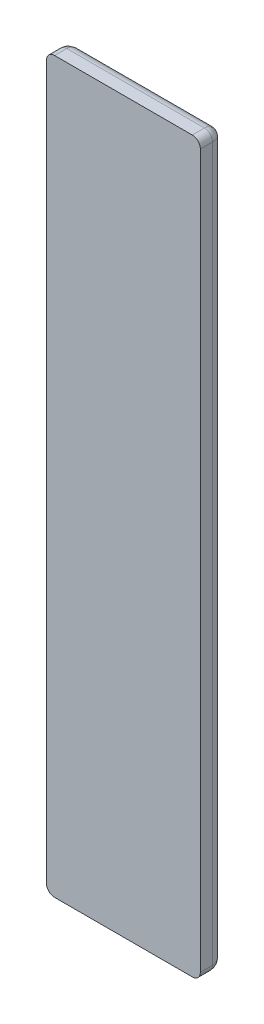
ISO-10303-21;
HEADER;
FILE_DESCRIPTION(('STEP AP214'),'2;1');
FILE_NAME('part.step','',(''),(''),'','','');
FILE_SCHEMA(('AUTOMOTIVE_DESIGN { 1 0 10303 214 1 1 1 1 }'));
ENDSEC;
DATA;
#1=APPLICATION_CONTEXT('core data for automotive mechanical design processes');
#2=APPLICATION_PROTOCOL_DEFINITION('international standard','automotive_design',2000,#1);
#3=PRODUCT_CONTEXT('',#1,'mechanical');
#4=PRODUCT('Part','Part','',(#3));
#5=PRODUCT_RELATED_PRODUCT_CATEGORY('part','',(#4));
#6=PRODUCT_DEFINITION_FORMATION('','',#4);
#7=PRODUCT_DEFINITION_CONTEXT('part definition',#1,'design');
#8=PRODUCT_DEFINITION('design','',#6,#7);
#9=PRODUCT_DEFINITION_SHAPE('','',#8);
#10=(LENGTH_UNIT() NAMED_UNIT(*) SI_UNIT(.MILLI.,.METRE.));
#11=(NAMED_UNIT(*) PLANE_ANGLE_UNIT() SI_UNIT($,.RADIAN.));
#12=(NAMED_UNIT(*) SI_UNIT($,.STERADIAN.) SOLID_ANGLE_UNIT());
#13=UNCERTAINTY_MEASURE_WITH_UNIT(LENGTH_MEASURE(1.E-05),#10,'distance_accuracy_value','');
#14=(GEOMETRIC_REPRESENTATION_CONTEXT(3) GLOBAL_UNCERTAINTY_ASSIGNED_CONTEXT((#13)) GLOBAL_UNIT_ASSIGNED_CONTEXT((#10,
#11,#12)) REPRESENTATION_CONTEXT('',''));
#15=CARTESIAN_POINT('',(0.,0.,0.));
#16=DIRECTION('',(0.,0.,1.));
#17=DIRECTION('',(1.,0.,0.));
#18=AXIS2_PLACEMENT_3D('',#15,#16,#17);
#19=CARTESIAN_POINT('',(8.5,-45.,1.5));
#20=CARTESIAN_POINT('',(8.64959965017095,-45.,1.5));
#21=CARTESIAN_POINT('',(8.8738193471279,-44.9486403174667,1.5));
#22=CARTESIAN_POINT('',(9.12870055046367,-44.7883228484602,1.5));
#23=CARTESIAN_POINT('',(9.31506284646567,-44.6021495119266,1.5));
#24=CARTESIAN_POINT('',(9.46187554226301,-44.3365630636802,1.5));
#25=CARTESIAN_POINT('',(9.5,-44.1121997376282,1.5));
#26=CARTESIAN_POINT('',(9.5,-44.,1.5));
#27=CARTESIAN_POINT('',(8.5,-45.,1.38780026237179));
#28=CARTESIAN_POINT('',(8.64959965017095,-45.,1.3765841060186));
#29=CARTESIAN_POINT('',(8.8738193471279,-44.9486403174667,1.36367785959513));
#30=CARTESIAN_POINT('',(9.12870055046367,-44.7883228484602,1.35659921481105));
#31=CARTESIAN_POINT('',(9.31506284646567,-44.6021495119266,1.3565890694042));
#32=CARTESIAN_POINT('',(9.46187554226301,-44.3365630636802,1.36547389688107));
#33=CARTESIAN_POINT('',(9.5,-44.1121997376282,1.37940644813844));
#34=CARTESIAN_POINT('',(9.5,-44.,1.38780026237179));
#35=CARTESIAN_POINT('',(8.49366779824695,-44.9810033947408,1.21952370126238));
#36=CARTESIAN_POINT('',(8.63881086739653,-44.9769975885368,1.19182022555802));
#37=CARTESIAN_POINT('',(8.8563533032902,-44.9220110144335,1.15996676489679));
#38=CARTESIAN_POINT('',(9.10512270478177,-44.762108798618,1.14251053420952));
#39=CARTESIAN_POINT('',(9.28839101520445,-44.5790066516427,1.14248469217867));
#40=CARTESIAN_POINT('',(9.43560601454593,-44.3201993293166,1.16439540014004));
#41=CARTESIAN_POINT('',(9.47797920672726,-44.1025202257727,1.19878476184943));
#42=CARTESIAN_POINT('',(9.48100339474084,-43.9936677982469,1.21952370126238));
#43=CARTESIAN_POINT('',(8.4625698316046,-44.8877094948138,0.895591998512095));
#44=CARTESIAN_POINT('',(8.58874386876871,-44.8682151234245,0.84618721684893));
#45=CARTESIAN_POINT('',(8.77793452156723,-44.8005005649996,0.789960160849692));
#46=CARTESIAN_POINT('',(8.99992776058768,-44.6445508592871,0.759265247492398));
#47=CARTESIAN_POINT('',(9.16874460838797,-44.4758515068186,0.759226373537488));
#48=CARTESIAN_POINT('',(9.31524302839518,-44.24646229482,0.797731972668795));
#49=CARTESIAN_POINT('',(9.37312822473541,-44.0572129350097,0.858599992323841));
#50=CARTESIAN_POINT('',(9.3877094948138,-43.9625698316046,0.895591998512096));
#51=CARTESIAN_POINT('',(8.38926970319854,-44.6678091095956,0.496987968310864));
#52=CARTESIAN_POINT('',(8.47892262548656,-44.6235301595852,0.445953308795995));
#53=CARTESIAN_POINT('',(8.61343601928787,-44.5389488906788,0.389505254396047));
#54=CARTESIAN_POINT('',(8.78104679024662,-44.3980517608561,0.359034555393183));
#55=CARTESIAN_POINT('',(8.9175890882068,-44.2615472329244,0.359012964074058));
#56=CARTESIAN_POINT('',(9.05464174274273,-44.0910218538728,0.397175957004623));
#57=CARTESIAN_POINT('',(9.13467797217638,-43.9565316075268,0.458742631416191));
#58=CARTESIAN_POINT('',(9.1678091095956,-43.8892697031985,0.496987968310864));
#59=CARTESIAN_POINT('',(8.22436815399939,-44.1731044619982,0.102458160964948));
#60=CARTESIAN_POINT('',(8.26696008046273,-44.130167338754,0.08846426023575));
#61=CARTESIAN_POINT('',(8.3308831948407,-44.0659433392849,0.07374113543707));
#62=CARTESIAN_POINT('',(8.41623705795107,-43.9803248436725,0.065954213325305));
#63=CARTESIAN_POINT('',(8.49102389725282,-43.9055529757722,0.065956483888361));
#64=CARTESIAN_POINT('',(8.57666237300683,-43.820226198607,0.075679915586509));
#65=CARTESIAN_POINT('',(8.64096522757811,-43.7563284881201,0.091952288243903));
#66=CARTESIAN_POINT('',(8.67310446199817,-43.7243681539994,0.102458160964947));
#67=CARTESIAN_POINT('',(8.07479982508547,-43.7243994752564,0.));
#68=CARTESIAN_POINT('',(8.08904741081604,-43.7101518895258,0.));
#69=CARTESIAN_POINT('',(8.11041878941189,-43.68878051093,0.));
#70=CARTESIAN_POINT('',(8.13891396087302,-43.6602853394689,0.));
#71=CARTESIAN_POINT('',(8.16384723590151,-43.6353520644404,0.));
#72=CARTESIAN_POINT('',(8.19234240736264,-43.6068568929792,0.));
#73=CARTESIAN_POINT('',(8.21371378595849,-43.5854855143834,0.));
#74=CARTESIAN_POINT('',(8.22439947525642,-43.5747998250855,0.));
#75=CARTESIAN_POINT('',(8.,-43.5,0.));
#76=CARTESIAN_POINT('',(8.,-43.5,0.));
#77=CARTESIAN_POINT('',(8.00000000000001,-43.5,0.));
#78=CARTESIAN_POINT('',(8.00000000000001,-43.5,0.));
#79=CARTESIAN_POINT('',(8.,-43.5,0.));
#80=CARTESIAN_POINT('',(8.00000000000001,-43.5,0.));
#81=CARTESIAN_POINT('',(8.,-43.5,0.));
#82=CARTESIAN_POINT('',(8.,-43.5,0.));
#83=B_SPLINE_SURFACE_WITH_KNOTS('',3,3,((#19,#20,#21,#22,#23,#24,#25,#26),(#27,#28,#29,#30,#31,
#32,#33,#34),(#35,#36,#37,#38,#39,#40,#41,#42),(#43,#44,#45,#46,#47,#48,#49,#50),(#51,#52,#53,
#54,#55,#56,#57,#58),(#59,#60,#61,#62,#63,#64,#65,#66),(#67,#68,#69,#70,#71,#72,#73,#74),(#75,
#76,#77,#78,#79,#80,#81,#82)),.UNSPECIFIED.,.F.,.F.,.F.,(4,1,1,1,1,4),(4,1,1,1,1,4),(0.,
0.224399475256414,0.336599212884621,0.673198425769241,1.12199737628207,1.5707963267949),(0.,
0.285714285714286,0.428571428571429,0.571428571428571,0.785714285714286,1.),.UNSPECIFIED.);
#84=CARTESIAN_POINT('',(8.,-43.5,0.));
#85=CARTESIAN_POINT('',(8.22439947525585,-43.574799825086,0.));
#86=CARTESIAN_POINT('',(8.67310446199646,-43.7243681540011,0.102458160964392));
#87=CARTESIAN_POINT('',(9.16780910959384,-43.8892697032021,0.496987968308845));
#88=CARTESIAN_POINT('',(9.38770949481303,-43.9625698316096,0.895591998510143));
#89=CARTESIAN_POINT('',(9.48100339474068,-43.9936677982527,1.21952370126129));
#90=CARTESIAN_POINT('',(9.5,-44.0000000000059,1.38780026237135));
#91=CARTESIAN_POINT('',(9.5,-44.0000000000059,1.5));
#92=B_SPLINE_CURVE_WITH_KNOTS('',3,(#84,#85,#86,#87,#88,#89,#90,#91),.UNSPECIFIED.,.F.,.F.,(4,1,
1,1,1,4),(0.,0.448798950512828,0.897597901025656,1.23419711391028,1.34639685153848,
1.5707963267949),.UNSPECIFIED.);
#93=CARTESIAN_POINT('',(9.5,-44.,1.5));
#94=VERTEX_POINT('',#93);
#95=CARTESIAN_POINT('',(8.00000000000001,-43.5,0.));
#96=VERTEX_POINT('',#95);
#97=EDGE_CURVE('E112',#94,#96,#92,.F.);
#98=CARTESIAN_POINT('',(9.5,-44.,1.5));
#99=CARTESIAN_POINT('',(9.50000000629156,-44.0130898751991,1.5));
#100=CARTESIAN_POINT('',(9.49974054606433,-44.0261796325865,1.5));
#101=CARTESIAN_POINT('',(9.49870609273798,-44.0523387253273,1.5));
#102=CARTESIAN_POINT('',(9.49793110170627,-44.0654080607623,1.5));
#103=CARTESIAN_POINT('',(9.49586897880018,-44.0915063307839,1.5));
#104=CARTESIAN_POINT('',(9.49458184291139,-44.104535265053,1.5));
#105=CARTESIAN_POINT('',(9.49149881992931,-44.1305328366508,1.5));
#106=CARTESIAN_POINT('',(9.48970293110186,-44.1435014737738,1.5));
#107=CARTESIAN_POINT('',(9.48560577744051,-44.1693585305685,1.5));
#108=CARTESIAN_POINT('',(9.48330451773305,-44.1822469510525,1.5));
#109=CARTESIAN_POINT('',(9.47820000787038,-44.2079236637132,1.5));
#110=CARTESIAN_POINT('',(9.47539677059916,-44.220711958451,1.5));
#111=CARTESIAN_POINT('',(9.4692916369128,-44.2461684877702,1.5));
#112=CARTESIAN_POINT('',(9.46598975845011,-44.2588367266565,1.5));
#113=CARTESIAN_POINT('',(9.45889087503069,-44.284033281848,1.5));
#114=CARTESIAN_POINT('',(9.45509388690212,-44.2965616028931,1.5));
#115=CARTESIAN_POINT('',(9.44700758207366,-44.3214582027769,1.5));
#116=CARTESIAN_POINT('',(9.44271827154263,-44.3338264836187,1.5));
#117=CARTESIAN_POINT('',(9.43365345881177,-44.3583838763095,1.5));
#118=CARTESIAN_POINT('',(9.42887794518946,-44.3705729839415,1.5));
#119=CARTESIAN_POINT('',(9.41885130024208,-44.3947545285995,1.5));
#120=CARTESIAN_POINT('',(9.41360014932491,-44.4067469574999,1.5));
#121=CARTESIAN_POINT('',(9.40263191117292,-44.4305173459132,1.5));
#122=CARTESIAN_POINT('',(9.39691480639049,-44.4422952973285,1.5));
#123=CARTESIAN_POINT('',(9.38502456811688,-44.4656190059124,1.5));
#124=CARTESIAN_POINT('',(9.37885142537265,-44.4771647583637,1.5));
#125=CARTESIAN_POINT('',(9.36605894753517,-44.5000063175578,1.5));
#126=CARTESIAN_POINT('',(9.35943961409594,-44.511302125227,1.5));
#127=CARTESIAN_POINT('',(9.34576461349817,-44.5336260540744,1.5));
#128=CARTESIAN_POINT('',(9.33870895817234,-44.5446541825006,1.5));
#129=CARTESIAN_POINT('',(9.32417113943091,-44.566424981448,1.5));
#130=CARTESIAN_POINT('',(9.3166889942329,-44.5771676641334,1.5));
#131=CARTESIAN_POINT('',(9.30130813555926,-44.5983499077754,1.5));
#132=CARTESIAN_POINT('',(9.2934094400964,-44.608789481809,1.5));
#133=CARTESIAN_POINT('',(9.27720501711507,-44.6293474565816,1.5));
#134=CARTESIAN_POINT('',(9.26889929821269,-44.6394658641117,1.5));
#135=CARTESIAN_POINT('',(9.25189515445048,-44.6593673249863,1.5));
#136=CARTESIAN_POINT('',(9.24319672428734,-44.6691503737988,1.5));
#137=CARTESIAN_POINT('',(9.22542209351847,-44.6883676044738,1.5));
#138=CARTESIAN_POINT('',(9.21634588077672,-44.6978017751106,1.5));
#139=CARTESIAN_POINT('',(9.19783043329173,-44.7163075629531,1.5));
#140=CARTESIAN_POINT('',(9.18839118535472,-44.7253791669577,1.5));
#141=CARTESIAN_POINT('',(9.16916447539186,-44.7431461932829,1.5));
#142=CARTESIAN_POINT('',(9.15937700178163,-44.7518416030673,1.5));
#143=CARTESIAN_POINT('',(9.13946856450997,-44.7688425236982,1.5));
#144=CARTESIAN_POINT('',(9.12934759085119,-44.7771480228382,1.5));
#145=CARTESIAN_POINT('',(9.10878722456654,-44.7933556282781,1.5));
#146=CARTESIAN_POINT('',(9.09834782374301,-44.8012577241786,1.5));
#147=CARTESIAN_POINT('',(9.07716745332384,-44.8166469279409,1.5));
#148=CARTESIAN_POINT('',(9.06642648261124,-44.8241340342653,1.5));
#149=CARTESIAN_POINT('',(9.04465968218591,-44.8386814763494,1.5));
#150=CARTESIAN_POINT('',(9.03363385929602,-44.8457418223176,1.5));
#151=CARTESIAN_POINT('',(9.0113140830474,-44.8594239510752,1.5));
#152=CARTESIAN_POINT('',(9.00002014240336,-44.8660457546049,1.5));
#153=CARTESIAN_POINT('',(8.97718094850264,-44.8788391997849,1.5));
#154=CARTESIAN_POINT('',(8.96563571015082,-44.8850108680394,1.5));
#155=CARTESIAN_POINT('',(8.9423103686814,-44.8968916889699,1.5));
#156=CARTESIAN_POINT('',(8.930530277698,-44.9026008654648,1.5));
#157=CARTESIAN_POINT('',(8.90675324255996,-44.9135477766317,1.5));
#158=CARTESIAN_POINT('',(8.89475630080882,-44.9187855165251,1.5));
#159=CARTESIAN_POINT('',(8.87056545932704,-44.9287854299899,1.5));
#160=CARTESIAN_POINT('',(8.85837155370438,-44.9335475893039,1.5));
#161=CARTESIAN_POINT('',(8.83380620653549,-44.9425913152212,1.5));
#162=CARTESIAN_POINT('',(8.82143475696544,-44.9468728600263,1.5));
#163=CARTESIAN_POINT('',(8.79653385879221,-44.9549505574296,1.5));
#164=CARTESIAN_POINT('',(8.78400440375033,-44.9587466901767,1.5));
#165=CARTESIAN_POINT('',(8.75880699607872,-44.9658486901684,1.5));
#166=CARTESIAN_POINT('',(8.74613904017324,-44.9691545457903,1.5));
#167=CARTESIAN_POINT('',(8.72068413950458,-44.9752711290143,1.5));
#168=CARTESIAN_POINT('',(8.70789719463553,-44.978081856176,1.5));
#169=CARTESIAN_POINT('',(8.68222382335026,-44.9832033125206,1.5));
#170=CARTESIAN_POINT('',(8.66933739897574,-44.985514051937,1.5));
#171=CARTESIAN_POINT('',(8.64348457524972,-44.9896306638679,1.5));
#172=CARTESIAN_POINT('',(8.63051817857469,-44.9914365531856,1.5));
#173=CARTESIAN_POINT('',(8.60452492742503,-44.9945386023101,1.5));
#174=CARTESIAN_POINT('',(8.5914980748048,-44.9958347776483,1.5));
#175=CARTESIAN_POINT('',(8.56540339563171,-44.9979125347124,1.5));
#176=CARTESIAN_POINT('',(8.55233556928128,-44.9986941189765,1.5));
#177=CARTESIAN_POINT('',(8.52617855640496,-44.9997378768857,1.5));
#178=CARTESIAN_POINT('',(8.51308936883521,-45.0000000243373,1.5));
#179=CARTESIAN_POINT('',(8.5,-45.,1.5));
#180=B_SPLINE_CURVE_WITH_KNOTS('',3,(#98,#99,#100,#101,#102,#103,#104,#105,#106,#107,#108,#109,
#110,#111,#112,#113,#114,#115,#116,#117,#118,#119,#120,#121,#122,#123,#124,#125,#126,#127,#128,
#129,#130,#131,#132,#133,#134,#135,#136,#137,#138,#139,#140,#141,#142,#143,#144,#145,#146,#147,
#148,#149,#150,#151,#152,#153,#154,#155,#156,#157,#158,#159,#160,#161,#162,#163,#164,#165,#166,
#167,#168,#169,#170,#171,#172,#173,#174,#175,#176,#177,#178,#179),.UNSPECIFIED.,.F.,.F.,(4,2,2,
2,2,2,2,2,2,2,2,2,2,2,2,2,2,2,2,2,2,2,2,2,2,2,2,2,2,2,2,2,2,2,2,2,2,2,2,2,4),(0.,
0.0392668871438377,0.0785336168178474,0.117800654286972,0.157067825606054,0.19633459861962,
0.235600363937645,0.274864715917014,0.31412773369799,0.353390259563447,0.392653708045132,
0.43191877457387,0.471185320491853,0.510452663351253,0.549719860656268,0.588985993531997,
0.628250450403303,0.667513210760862,0.706775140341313,0.746037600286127,0.785301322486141,
0.824566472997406,0.863832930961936,0.903100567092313,0.942369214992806,0.981638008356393,
1.02090586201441,1.06017185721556,1.09943552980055,1.13869717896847,1.17795839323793,
1.21722078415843,1.25648495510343,1.29575073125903,1.33501743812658,1.37428417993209,
1.41355011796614,1.45281474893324,1.49207818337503,1.53134142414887,1.57060664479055),.UNSPECIFIED.);
#181=CARTESIAN_POINT('',(8.50000000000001,-45.,1.5));
#182=VERTEX_POINT('',#181);
#183=EDGE_CURVE('E95',#94,#182,#180,.T.);
#184=CARTESIAN_POINT('',(8.50000000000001,-45.,1.5));
#185=CARTESIAN_POINT('',(8.50000000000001,-45.,1.38780026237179));
#186=CARTESIAN_POINT('',(8.49366779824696,-44.9810033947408,1.21952370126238));
#187=CARTESIAN_POINT('',(8.46256983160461,-44.8877094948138,0.895591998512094));
#188=CARTESIAN_POINT('',(8.38926970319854,-44.6678091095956,0.496987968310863));
#189=CARTESIAN_POINT('',(8.22436815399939,-44.1731044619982,0.102458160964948));
#190=CARTESIAN_POINT('',(8.07479982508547,-43.7243994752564,0.));
#191=CARTESIAN_POINT('',(8.,-43.5,0.));
#192=B_SPLINE_CURVE_WITH_KNOTS('',3,(#184,#185,#186,#187,#188,#189,#190,#191),.UNSPECIFIED.,.F.,
.F.,(4,1,1,1,1,4),(0.,0.224399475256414,0.336599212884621,0.673198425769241,1.12199737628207,
1.5707963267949),.UNSPECIFIED.);
#193=EDGE_CURVE('E116',#96,#182,#192,.F.);
#194=ORIENTED_EDGE('',*,*,#97,.F.);
#195=ORIENTED_EDGE('',*,*,#183,.T.);
#196=ORIENTED_EDGE('',*,*,#193,.F.);
#197=EDGE_LOOP('',(#194,#195,#196));
#198=FACE_BOUND('',#197,.T.);
#199=ADVANCED_FACE('F15',(#198),#83,.T.);
#200=CARTESIAN_POINT('',(9.5,44.,1.5));
#201=CARTESIAN_POINT('',(9.5,44.1495996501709,1.5));
#202=CARTESIAN_POINT('',(9.44864031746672,44.3738193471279,1.5));
#203=CARTESIAN_POINT('',(9.28832284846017,44.6287005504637,1.5));
#204=CARTESIAN_POINT('',(9.10214951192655,44.8150628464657,1.5));
#205=CARTESIAN_POINT('',(8.83656306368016,44.961875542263,1.5));
#206=CARTESIAN_POINT('',(8.6121997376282,45.,1.5));
#207=CARTESIAN_POINT('',(8.49999999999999,45.,1.5));
#208=CARTESIAN_POINT('',(9.5,44.,1.38780026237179));
#209=CARTESIAN_POINT('',(9.5,44.1495996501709,1.3765841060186));
#210=CARTESIAN_POINT('',(9.44864031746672,44.3738193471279,1.36367785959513));
#211=CARTESIAN_POINT('',(9.28832284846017,44.6287005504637,1.35659921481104));
#212=CARTESIAN_POINT('',(9.10214951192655,44.8150628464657,1.3565890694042));
#213=CARTESIAN_POINT('',(8.83656306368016,44.961875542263,1.36547389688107));
#214=CARTESIAN_POINT('',(8.6121997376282,45.,1.37940644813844));
#215=CARTESIAN_POINT('',(8.49999999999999,45.,1.38780026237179));
#216=CARTESIAN_POINT('',(9.47458969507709,43.991529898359,1.16353957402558));
#217=CARTESIAN_POINT('',(9.46943690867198,44.1352784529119,1.13007542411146));
#218=CARTESIAN_POINT('',(9.413443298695,44.3507395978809,1.09154236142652));
#219=CARTESIAN_POINT('',(9.25372843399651,44.5975902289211,1.07041139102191));
#220=CARTESIAN_POINT('',(9.07161358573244,44.7798672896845,1.07037983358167));
#221=CARTESIAN_POINT('',(8.81492836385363,44.9271391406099,1.09690472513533));
#222=CARTESIAN_POINT('',(8.59933848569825,44.9707115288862,1.13849098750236));
#223=CARTESIAN_POINT('',(8.49152989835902,44.9745896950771,1.16353957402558));
#224=CARTESIAN_POINT('',(9.3257630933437,43.9419210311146,0.736967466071));
#225=CARTESIAN_POINT('',(9.29621785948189,44.0557411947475,0.680635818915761));
#226=CARTESIAN_POINT('',(9.22040081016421,44.2264579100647,0.617015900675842));
#227=CARTESIAN_POINT('',(9.0672974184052,44.4308835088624,0.582387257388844));
#228=CARTESIAN_POINT('',(8.90816311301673,44.5901034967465,0.582348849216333));
#229=CARTESIAN_POINT('',(8.69803879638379,44.7358470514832,0.625770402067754));
#230=CARTESIAN_POINT('',(8.52730721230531,44.8036733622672,0.694781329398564));
#231=CARTESIAN_POINT('',(8.44192103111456,44.8257630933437,0.736967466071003));
#232=CARTESIAN_POINT('',(9.0388441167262,43.8462813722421,0.377484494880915));
#233=CARTESIAN_POINT('',(8.99249073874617,43.9223638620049,0.337544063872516));
#234=CARTESIAN_POINT('',(8.91096514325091,44.0365142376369,0.293819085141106));
#235=CARTESIAN_POINT('',(8.78382816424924,44.1810775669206,0.270310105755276));
#236=CARTESIAN_POINT('',(8.6639526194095,44.300978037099,0.270298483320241));
#237=CARTESIAN_POINT('',(8.51749138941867,44.4256058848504,0.299724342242));
#238=CARTESIAN_POINT('',(8.40335944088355,44.5041378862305,0.347544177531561));
#239=CARTESIAN_POINT('',(8.34628137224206,44.5388441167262,0.377484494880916));
#240=CARTESIAN_POINT('',(8.56058350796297,43.686861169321,0.077173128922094));
#241=CARTESIAN_POINT('',(8.52545042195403,43.7226854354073,0.066452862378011));
#242=CARTESIAN_POINT('',(8.47257506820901,43.7764541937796,0.055008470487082));
#243=CARTESIAN_POINT('',(8.40145681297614,43.8479670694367,0.048919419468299));
#244=CARTESIAN_POINT('',(8.33904986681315,43.9103892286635,0.048919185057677));
#245=CARTESIAN_POINT('',(8.26749027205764,43.9814337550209,0.056529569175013));
#246=CARTESIAN_POINT('',(8.21374473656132,44.0342920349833,0.069127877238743));
#247=CARTESIAN_POINT('',(8.18686116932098,44.060583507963,0.077173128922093));
#248=CARTESIAN_POINT('',(8.22439947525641,43.5747998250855,0.));
#249=CARTESIAN_POINT('',(8.21015188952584,43.589047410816,0.));
#250=CARTESIAN_POINT('',(8.18878051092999,43.6104187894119,0.));
#251=CARTESIAN_POINT('',(8.16028533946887,43.638913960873,0.));
#252=CARTESIAN_POINT('',(8.13535206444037,43.6638472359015,0.));
#253=CARTESIAN_POINT('',(8.10685689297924,43.6923424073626,0.));
#254=CARTESIAN_POINT('',(8.08548551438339,43.7137137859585,0.));
#255=CARTESIAN_POINT('',(8.07479982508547,43.7243994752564,0.));
#256=CARTESIAN_POINT('',(8.,43.5,0.));
#257=CARTESIAN_POINT('',(8.,43.5,0.));
#258=CARTESIAN_POINT('',(8.,43.5,0.));
#259=CARTESIAN_POINT('',(8.,43.5,0.));
#260=CARTESIAN_POINT('',(8.,43.5,0.));
#261=CARTESIAN_POINT('',(8.,43.5,0.));
#262=CARTESIAN_POINT('',(8.,43.5,0.));
#263=CARTESIAN_POINT('',(8.,43.5,0.));
#264=B_SPLINE_SURFACE_WITH_KNOTS('',3,3,((#200,#201,#202,#203,#204,#205,#206,#207),(#208,#209,
#210,#211,#212,#213,#214,#215),(#216,#217,#218,#219,#220,#221,#222,#223),(#224,#225,#226,#227,
#228,#229,#230,#231),(#232,#233,#234,#235,#236,#237,#238,#239),(#240,#241,#242,#243,#244,#245,
#246,#247),(#248,#249,#250,#251,#252,#253,#254,#255),(#256,#257,#258,#259,#260,#261,#262,#263)),
.UNSPECIFIED.,.F.,.F.,.F.,(4,1,1,1,1,4),(4,1,1,1,1,4),(0.,0.224399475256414,0.448798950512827,
0.897597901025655,1.12199737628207,1.5707963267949),(0.,0.285714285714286,0.428571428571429,
0.571428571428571,0.785714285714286,1.),.UNSPECIFIED.);
#265=CARTESIAN_POINT('',(8.,43.5,0.));
#266=CARTESIAN_POINT('',(8.07479982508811,43.7243994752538,0.));
#267=CARTESIAN_POINT('',(8.18686116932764,44.0605835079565,0.0771731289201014));
#268=CARTESIAN_POINT('',(8.34628137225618,44.5388441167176,0.377484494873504));
#269=CARTESIAN_POINT('',(8.4419210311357,44.8257630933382,0.73696746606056));
#270=CARTESIAN_POINT('',(8.49152989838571,44.9745896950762,1.16353957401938));
#271=CARTESIAN_POINT('',(8.50000000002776,45.,1.38780026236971));
#272=CARTESIAN_POINT('',(8.50000000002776,45.,1.5));
#273=B_SPLINE_CURVE_WITH_KNOTS('',3,(#265,#266,#267,#268,#269,#270,#271,#272),.UNSPECIFIED.,.F.,
.F.,(4,1,1,1,1,4),(0.,0.448798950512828,0.673198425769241,1.12199737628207,1.34639685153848,
1.5707963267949),.UNSPECIFIED.);
#274=CARTESIAN_POINT('',(8.50000000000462,45.,1.5));
#275=VERTEX_POINT('',#274);
#276=CARTESIAN_POINT('',(8.,43.5,0.));
#277=VERTEX_POINT('',#276);
#278=EDGE_CURVE('E231',#275,#277,#273,.F.);
#279=CARTESIAN_POINT('',(8.49999999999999,45.,1.5));
#280=CARTESIAN_POINT('',(8.51308987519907,45.0000000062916,1.5));
#281=CARTESIAN_POINT('',(8.52617963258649,44.9997405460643,1.5));
#282=CARTESIAN_POINT('',(8.55233872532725,44.998706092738,1.5));
#283=CARTESIAN_POINT('',(8.56540806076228,44.9979311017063,1.5));
#284=CARTESIAN_POINT('',(8.59150633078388,44.9958689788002,1.5));
#285=CARTESIAN_POINT('',(8.60453526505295,44.9945818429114,1.5));
#286=CARTESIAN_POINT('',(8.63053283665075,44.9914988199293,1.5));
#287=CARTESIAN_POINT('',(8.64350147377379,44.9897029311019,1.5));
#288=CARTESIAN_POINT('',(8.66935853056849,44.9856057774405,1.5));
#289=CARTESIAN_POINT('',(8.68224695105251,44.9833045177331,1.5));
#290=CARTESIAN_POINT('',(8.70792366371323,44.9782000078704,1.5));
#291=CARTESIAN_POINT('',(8.72071195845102,44.9753967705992,1.5));
#292=CARTESIAN_POINT('',(8.74616848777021,44.9692916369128,1.5));
#293=CARTESIAN_POINT('',(8.75883672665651,44.9659897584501,1.5));
#294=CARTESIAN_POINT('',(8.78403328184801,44.9588908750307,1.5));
#295=CARTESIAN_POINT('',(8.79656160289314,44.9550938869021,1.5));
#296=CARTESIAN_POINT('',(8.82145820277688,44.9470075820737,1.5));
#297=CARTESIAN_POINT('',(8.83382648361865,44.9427182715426,1.5));
#298=CARTESIAN_POINT('',(8.85838387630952,44.9336534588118,1.5));
#299=CARTESIAN_POINT('',(8.87057298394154,44.9288779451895,1.5));
#300=CARTESIAN_POINT('',(8.89475452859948,44.9188513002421,1.5));
#301=CARTESIAN_POINT('',(8.90674695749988,44.9136001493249,1.5));
#302=CARTESIAN_POINT('',(8.93051734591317,44.9026319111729,1.5));
#303=CARTESIAN_POINT('',(8.94229529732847,44.8969148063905,1.5));
#304=CARTESIAN_POINT('',(8.9656190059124,44.8850245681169,1.5));
#305=CARTESIAN_POINT('',(8.97716475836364,44.8788514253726,1.5));
#306=CARTESIAN_POINT('',(9.00000631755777,44.8660589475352,1.5));
#307=CARTESIAN_POINT('',(9.01130212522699,44.8594396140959,1.5));
#308=CARTESIAN_POINT('',(9.03362605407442,44.8457646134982,1.5));
#309=CARTESIAN_POINT('',(9.0446541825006,44.8387089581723,1.5));
#310=CARTESIAN_POINT('',(9.06642498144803,44.8241711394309,1.5));
#311=CARTESIAN_POINT('',(9.07716766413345,44.8166889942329,1.5));
#312=CARTESIAN_POINT('',(9.09834990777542,44.8013081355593,1.5));
#313=CARTESIAN_POINT('',(9.108789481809,44.7934094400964,1.5));
#314=CARTESIAN_POINT('',(9.12934745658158,44.7772050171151,1.5));
#315=CARTESIAN_POINT('',(9.13946586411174,44.7688992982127,1.5));
#316=CARTESIAN_POINT('',(9.1593673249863,44.7518951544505,1.5));
#317=CARTESIAN_POINT('',(9.16915037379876,44.7431967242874,1.5));
#318=CARTESIAN_POINT('',(9.18836760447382,44.7254220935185,1.5));
#319=CARTESIAN_POINT('',(9.19780177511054,44.7163458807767,1.5));
#320=CARTESIAN_POINT('',(9.21630756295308,44.6978304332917,1.5));
#321=CARTESIAN_POINT('',(9.22537916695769,44.6883911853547,1.5));
#322=CARTESIAN_POINT('',(9.24314619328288,44.6691644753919,1.5));
#323=CARTESIAN_POINT('',(9.25184160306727,44.6593770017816,1.5));
#324=CARTESIAN_POINT('',(9.2688425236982,44.63946856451,1.5));
#325=CARTESIAN_POINT('',(9.27714802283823,44.6293475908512,1.5));
#326=CARTESIAN_POINT('',(9.29335562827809,44.6087872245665,1.5));
#327=CARTESIAN_POINT('',(9.30125772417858,44.598347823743,1.5));
#328=CARTESIAN_POINT('',(9.31664692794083,44.5771674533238,1.5));
#329=CARTESIAN_POINT('',(9.32413403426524,44.5664264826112,1.5));
#330=CARTESIAN_POINT('',(9.33868147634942,44.5446596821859,1.5));
#331=CARTESIAN_POINT('',(9.34574182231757,44.533633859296,1.5));
#332=CARTESIAN_POINT('',(9.35942395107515,44.5113140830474,1.5));
#333=CARTESIAN_POINT('',(9.36604575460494,44.5000201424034,1.5));
#334=CARTESIAN_POINT('',(9.37883919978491,44.4771809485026,1.5));
#335=CARTESIAN_POINT('',(9.38501086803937,44.4656357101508,1.5));
#336=CARTESIAN_POINT('',(9.39689168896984,44.4423103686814,1.5));
#337=CARTESIAN_POINT('',(9.40260086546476,44.430530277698,1.5));
#338=CARTESIAN_POINT('',(9.4135477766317,44.40675324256,1.5));
#339=CARTESIAN_POINT('',(9.41878551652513,44.3947563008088,1.5));
#340=CARTESIAN_POINT('',(9.42878542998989,44.370565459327,1.5));
#341=CARTESIAN_POINT('',(9.43354758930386,44.3583715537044,1.5));
#342=CARTESIAN_POINT('',(9.44259131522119,44.3338062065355,1.5));
#343=CARTESIAN_POINT('',(9.4468728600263,44.3214347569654,1.5));
#344=CARTESIAN_POINT('',(9.4549505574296,44.2965338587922,1.5));
#345=CARTESIAN_POINT('',(9.45874669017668,44.2840044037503,1.5));
#346=CARTESIAN_POINT('',(9.46584869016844,44.2588069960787,1.5));
#347=CARTESIAN_POINT('',(9.46915454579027,44.2461390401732,1.5));
#348=CARTESIAN_POINT('',(9.47527112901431,44.2206841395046,1.5));
#349=CARTESIAN_POINT('',(9.47808185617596,44.2078971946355,1.5));
#350=CARTESIAN_POINT('',(9.48320331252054,44.1822238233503,1.5));
#351=CARTESIAN_POINT('',(9.48551405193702,44.1693373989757,1.5));
#352=CARTESIAN_POINT('',(9.48963066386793,44.1434845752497,1.5));
#353=CARTESIAN_POINT('',(9.4914365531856,44.1305181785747,1.5));
#354=CARTESIAN_POINT('',(9.49453860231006,44.104524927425,1.5));
#355=CARTESIAN_POINT('',(9.49583477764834,44.0914980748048,1.5));
#356=CARTESIAN_POINT('',(9.49791253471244,44.0654033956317,1.5));
#357=CARTESIAN_POINT('',(9.49869411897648,44.0523355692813,1.5));
#358=CARTESIAN_POINT('',(9.49973787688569,44.026178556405,1.5));
#359=CARTESIAN_POINT('',(9.50000002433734,44.0130893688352,1.5));
#360=CARTESIAN_POINT('',(9.5,44.,1.5));
#361=B_SPLINE_CURVE_WITH_KNOTS('',3,(#279,#280,#281,#282,#283,#284,#285,#286,#287,#288,#289,
#290,#291,#292,#293,#294,#295,#296,#297,#298,#299,#300,#301,#302,#303,#304,#305,#306,#307,#308,
#309,#310,#311,#312,#313,#314,#315,#316,#317,#318,#319,#320,#321,#322,#323,#324,#325,#326,#327,
#328,#329,#330,#331,#332,#333,#334,#335,#336,#337,#338,#339,#340,#341,#342,#343,#344,#345,#346,
#347,#348,#349,#350,#351,#352,#353,#354,#355,#356,#357,#358,#359,#360),.UNSPECIFIED.,.F.,.F.,(4,
2,2,2,2,2,2,2,2,2,2,2,2,2,2,2,2,2,2,2,2,2,2,2,2,2,2,2,2,2,2,2,2,2,2,2,2,2,2,2,4),(0.,
0.0392668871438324,0.0785336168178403,0.117800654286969,0.157067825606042,0.196334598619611,
0.235600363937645,0.274864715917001,0.314127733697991,0.353390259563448,0.392653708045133,
0.431918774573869,0.471185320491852,0.51045266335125,0.549719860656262,0.588985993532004,
0.628250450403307,0.667513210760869,0.706775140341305,0.746037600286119,0.785301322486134,
0.824566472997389,0.863832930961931,0.903100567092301,0.942369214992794,0.981638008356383,
1.0209058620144,1.06017185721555,1.09943552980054,1.13869717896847,1.17795839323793,
1.21722078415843,1.25648495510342,1.29575073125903,1.33501743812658,1.37428417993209,
1.41355011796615,1.45281474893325,1.49207818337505,1.53134142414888,1.57060664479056),.UNSPECIFIED.);
#362=CARTESIAN_POINT('',(9.5,44.,1.5));
#363=VERTEX_POINT('',#362);
#364=EDGE_CURVE('E108',#275,#363,#361,.T.);
#365=CARTESIAN_POINT('',(9.5,44.,1.5));
#366=CARTESIAN_POINT('',(9.5,44.,1.38780026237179));
#367=CARTESIAN_POINT('',(9.47458969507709,43.9915298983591,1.16353957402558));
#368=CARTESIAN_POINT('',(9.3257630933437,43.9419210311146,0.736967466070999));
#369=CARTESIAN_POINT('',(9.0388441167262,43.8462813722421,0.377484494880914));
#370=CARTESIAN_POINT('',(8.56058350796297,43.686861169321,0.0771731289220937));
#371=CARTESIAN_POINT('',(8.22439947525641,43.5747998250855,0.));
#372=CARTESIAN_POINT('',(8.,43.5,0.));
#373=B_SPLINE_CURVE_WITH_KNOTS('',3,(#365,#366,#367,#368,#369,#370,#371,#372),.UNSPECIFIED.,.F.,
.F.,(4,1,1,1,1,4),(0.,0.224399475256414,0.448798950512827,0.897597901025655,1.12199737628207,
1.5707963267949),.UNSPECIFIED.);
#374=EDGE_CURVE('E123',#277,#363,#373,.F.);
#375=ORIENTED_EDGE('',*,*,#278,.F.);
#376=ORIENTED_EDGE('',*,*,#364,.T.);
#377=ORIENTED_EDGE('',*,*,#374,.F.);
#378=EDGE_LOOP('',(#375,#376,#377));
#379=FACE_BOUND('',#378,.T.);
#380=ADVANCED_FACE('F331',(#379),#264,.T.);
#381=CARTESIAN_POINT('',(-8.5,45.,1.5));
#382=CARTESIAN_POINT('',(-8.64959965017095,45.,1.5));
#383=CARTESIAN_POINT('',(-8.8738193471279,44.9486403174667,1.5));
#384=CARTESIAN_POINT('',(-9.12870055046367,44.7883228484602,1.5));
#385=CARTESIAN_POINT('',(-9.31506284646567,44.6021495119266,1.5));
#386=CARTESIAN_POINT('',(-9.46187554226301,44.3365630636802,1.5));
#387=CARTESIAN_POINT('',(-9.5,44.1121997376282,1.5));
#388=CARTESIAN_POINT('',(-9.5,44.,1.5));
#389=CARTESIAN_POINT('',(-8.5,45.,1.38780026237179));
#390=CARTESIAN_POINT('',(-8.64959965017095,45.,1.3765841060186));
#391=CARTESIAN_POINT('',(-8.8738193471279,44.9486403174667,1.36367785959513));
#392=CARTESIAN_POINT('',(-9.12870055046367,44.7883228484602,1.35659921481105));
#393=CARTESIAN_POINT('',(-9.31506284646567,44.6021495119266,1.3565890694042));
#394=CARTESIAN_POINT('',(-9.46187554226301,44.3365630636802,1.36547389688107));
#395=CARTESIAN_POINT('',(-9.5,44.1121997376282,1.37940644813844));
#396=CARTESIAN_POINT('',(-9.5,44.,1.38780026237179));
#397=CARTESIAN_POINT('',(-8.49366779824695,44.9810033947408,1.21952370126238));
#398=CARTESIAN_POINT('',(-8.63881086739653,44.9769975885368,1.19182022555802));
#399=CARTESIAN_POINT('',(-8.8563533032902,44.9220110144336,1.15996676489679));
#400=CARTESIAN_POINT('',(-9.10512270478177,44.762108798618,1.14251053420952));
#401=CARTESIAN_POINT('',(-9.28839101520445,44.5790066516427,1.14248469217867));
#402=CARTESIAN_POINT('',(-9.43560601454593,44.3201993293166,1.16439540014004));
#403=CARTESIAN_POINT('',(-9.47797920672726,44.1025202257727,1.19878476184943));
#404=CARTESIAN_POINT('',(-9.48100339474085,43.9936677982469,1.21952370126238));
#405=CARTESIAN_POINT('',(-8.4625698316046,44.8877094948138,0.895591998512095));
#406=CARTESIAN_POINT('',(-8.58874386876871,44.8682151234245,0.84618721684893));
#407=CARTESIAN_POINT('',(-8.77793452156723,44.8005005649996,0.789960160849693));
#408=CARTESIAN_POINT('',(-8.99992776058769,44.6445508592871,0.759265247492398));
#409=CARTESIAN_POINT('',(-9.16874460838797,44.4758515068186,0.759226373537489));
#410=CARTESIAN_POINT('',(-9.31524302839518,44.24646229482,0.797731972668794));
#411=CARTESIAN_POINT('',(-9.37312822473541,44.0572129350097,0.858599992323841));
#412=CARTESIAN_POINT('',(-9.3877094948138,43.9625698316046,0.895591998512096));
#413=CARTESIAN_POINT('',(-8.38926970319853,44.6678091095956,0.496987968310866));
#414=CARTESIAN_POINT('',(-8.47892262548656,44.6235301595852,0.445953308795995));
#415=CARTESIAN_POINT('',(-8.61343601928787,44.5389488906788,0.389505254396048));
#416=CARTESIAN_POINT('',(-8.78104679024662,44.3980517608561,0.359034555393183));
#417=CARTESIAN_POINT('',(-8.9175890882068,44.2615472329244,0.35901296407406));
#418=CARTESIAN_POINT('',(-9.05464174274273,44.0910218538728,0.397175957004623));
#419=CARTESIAN_POINT('',(-9.13467797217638,43.9565316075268,0.458742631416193));
#420=CARTESIAN_POINT('',(-9.1678091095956,43.8892697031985,0.496987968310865));
#421=CARTESIAN_POINT('',(-8.22436815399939,44.1731044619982,0.102458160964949));
#422=CARTESIAN_POINT('',(-8.26696008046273,44.130167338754,0.08846426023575));
#423=CARTESIAN_POINT('',(-8.3308831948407,44.0659433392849,0.07374113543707));
#424=CARTESIAN_POINT('',(-8.41623705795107,43.9803248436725,0.065954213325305));
#425=CARTESIAN_POINT('',(-8.49102389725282,43.9055529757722,0.065956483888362));
#426=CARTESIAN_POINT('',(-8.57666237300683,43.820226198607,0.075679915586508));
#427=CARTESIAN_POINT('',(-8.64096522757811,43.7563284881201,0.091952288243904));
#428=CARTESIAN_POINT('',(-8.67310446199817,43.7243681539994,0.102458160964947));
#429=CARTESIAN_POINT('',(-8.07479982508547,43.7243994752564,0.));
#430=CARTESIAN_POINT('',(-8.08904741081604,43.7101518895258,0.));
#431=CARTESIAN_POINT('',(-8.11041878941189,43.68878051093,0.));
#432=CARTESIAN_POINT('',(-8.13891396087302,43.6602853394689,0.));
#433=CARTESIAN_POINT('',(-8.16384723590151,43.6353520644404,0.));
#434=CARTESIAN_POINT('',(-8.19234240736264,43.6068568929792,0.));
#435=CARTESIAN_POINT('',(-8.21371378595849,43.5854855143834,0.));
#436=CARTESIAN_POINT('',(-8.22439947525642,43.5747998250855,0.));
#437=CARTESIAN_POINT('',(-8.,43.5,0.));
#438=CARTESIAN_POINT('',(-8.,43.5,0.));
#439=CARTESIAN_POINT('',(-8.00000000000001,43.5,0.));
#440=CARTESIAN_POINT('',(-8.00000000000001,43.5,0.));
#441=CARTESIAN_POINT('',(-8.00000000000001,43.5,0.));
#442=CARTESIAN_POINT('',(-8.00000000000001,43.5,0.));
#443=CARTESIAN_POINT('',(-8.00000000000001,43.5,0.));
#444=CARTESIAN_POINT('',(-8.00000000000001,43.5,0.));
#445=B_SPLINE_SURFACE_WITH_KNOTS('',3,3,((#381,#382,#383,#384,#385,#386,#387,#388),(#389,#390,
#391,#392,#393,#394,#395,#396),(#397,#398,#399,#400,#401,#402,#403,#404),(#405,#406,#407,#408,
#409,#410,#411,#412),(#413,#414,#415,#416,#417,#418,#419,#420),(#421,#422,#423,#424,#425,#426,
#427,#428),(#429,#430,#431,#432,#433,#434,#435,#436),(#437,#438,#439,#440,#441,#442,#443,#444)),
.UNSPECIFIED.,.F.,.F.,.F.,(4,1,1,1,1,4),(4,1,1,1,1,4),(0.,0.224399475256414,0.336599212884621,
0.673198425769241,1.12199737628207,1.5707963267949),(0.,0.285714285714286,0.428571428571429,
0.571428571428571,0.785714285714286,1.),.UNSPECIFIED.);
#446=CARTESIAN_POINT('',(-8.00000000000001,43.5,0.));
#447=CARTESIAN_POINT('',(-8.22439947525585,43.574799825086,0.));
#448=CARTESIAN_POINT('',(-8.67310446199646,43.7243681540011,0.102458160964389));
#449=CARTESIAN_POINT('',(-9.16780910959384,43.8892697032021,0.496987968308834));
#450=CARTESIAN_POINT('',(-9.38770949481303,43.9625698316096,0.895591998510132));
#451=CARTESIAN_POINT('',(-9.48100339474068,43.9936677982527,1.21952370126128));
#452=CARTESIAN_POINT('',(-9.5,44.000000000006,1.38780026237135));
#453=CARTESIAN_POINT('',(-9.5,44.000000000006,1.5));
#454=B_SPLINE_CURVE_WITH_KNOTS('',3,(#446,#447,#448,#449,#450,#451,#452,#453),.UNSPECIFIED.,.F.,
.F.,(4,1,1,1,1,4),(0.,0.448798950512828,0.897597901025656,1.23419711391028,1.34639685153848,
1.5707963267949),.UNSPECIFIED.);
#455=CARTESIAN_POINT('',(-9.5,44.,1.5));
#456=VERTEX_POINT('',#455);
#457=CARTESIAN_POINT('',(-8.00000000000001,43.5,0.));
#458=VERTEX_POINT('',#457);
#459=EDGE_CURVE('E170',#456,#458,#454,.F.);
#460=CARTESIAN_POINT('',(-9.5,44.,1.5));
#461=CARTESIAN_POINT('',(-9.50000000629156,44.0130898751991,1.5));
#462=CARTESIAN_POINT('',(-9.49974054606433,44.0261796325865,1.5));
#463=CARTESIAN_POINT('',(-9.49870609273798,44.0523387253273,1.5));
#464=CARTESIAN_POINT('',(-9.49793110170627,44.0654080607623,1.5));
#465=CARTESIAN_POINT('',(-9.49586897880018,44.0915063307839,1.5));
#466=CARTESIAN_POINT('',(-9.49458184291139,44.104535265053,1.5));
#467=CARTESIAN_POINT('',(-9.49149881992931,44.1305328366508,1.5));
#468=CARTESIAN_POINT('',(-9.48970293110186,44.1435014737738,1.5));
#469=CARTESIAN_POINT('',(-9.48560577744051,44.1693585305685,1.5));
#470=CARTESIAN_POINT('',(-9.48330451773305,44.1822469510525,1.5));
#471=CARTESIAN_POINT('',(-9.47820000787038,44.2079236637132,1.5));
#472=CARTESIAN_POINT('',(-9.47539677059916,44.220711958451,1.5));
#473=CARTESIAN_POINT('',(-9.4692916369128,44.2461684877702,1.5));
#474=CARTESIAN_POINT('',(-9.46598975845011,44.2588367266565,1.5));
#475=CARTESIAN_POINT('',(-9.45889087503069,44.284033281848,1.5));
#476=CARTESIAN_POINT('',(-9.45509388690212,44.2965616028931,1.5));
#477=CARTESIAN_POINT('',(-9.44700758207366,44.3214582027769,1.5));
#478=CARTESIAN_POINT('',(-9.44271827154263,44.3338264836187,1.5));
#479=CARTESIAN_POINT('',(-9.43365345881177,44.3583838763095,1.5));
#480=CARTESIAN_POINT('',(-9.42887794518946,44.3705729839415,1.5));
#481=CARTESIAN_POINT('',(-9.41885130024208,44.3947545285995,1.5));
#482=CARTESIAN_POINT('',(-9.41360014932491,44.4067469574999,1.5));
#483=CARTESIAN_POINT('',(-9.40263191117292,44.4305173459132,1.5));
#484=CARTESIAN_POINT('',(-9.39691480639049,44.4422952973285,1.5));
#485=CARTESIAN_POINT('',(-9.38502456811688,44.4656190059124,1.5));
#486=CARTESIAN_POINT('',(-9.37885142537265,44.4771647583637,1.5));
#487=CARTESIAN_POINT('',(-9.36605894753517,44.5000063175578,1.5));
#488=CARTESIAN_POINT('',(-9.35943961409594,44.511302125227,1.5));
#489=CARTESIAN_POINT('',(-9.34576461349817,44.5336260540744,1.5));
#490=CARTESIAN_POINT('',(-9.33870895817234,44.5446541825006,1.5));
#491=CARTESIAN_POINT('',(-9.32417113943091,44.566424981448,1.5));
#492=CARTESIAN_POINT('',(-9.3166889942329,44.5771676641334,1.5));
#493=CARTESIAN_POINT('',(-9.30130813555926,44.5983499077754,1.5));
#494=CARTESIAN_POINT('',(-9.2934094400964,44.608789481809,1.5));
#495=CARTESIAN_POINT('',(-9.27720501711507,44.6293474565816,1.5));
#496=CARTESIAN_POINT('',(-9.26889929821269,44.6394658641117,1.5));
#497=CARTESIAN_POINT('',(-9.25189515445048,44.6593673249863,1.5));
#498=CARTESIAN_POINT('',(-9.24319672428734,44.6691503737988,1.5));
#499=CARTESIAN_POINT('',(-9.22542209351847,44.6883676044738,1.5));
#500=CARTESIAN_POINT('',(-9.21634588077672,44.6978017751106,1.5));
#501=CARTESIAN_POINT('',(-9.19783043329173,44.7163075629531,1.5));
#502=CARTESIAN_POINT('',(-9.18839118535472,44.7253791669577,1.5));
#503=CARTESIAN_POINT('',(-9.16916447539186,44.7431461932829,1.5));
#504=CARTESIAN_POINT('',(-9.15937700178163,44.7518416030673,1.5));
#505=CARTESIAN_POINT('',(-9.13946856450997,44.7688425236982,1.5));
#506=CARTESIAN_POINT('',(-9.12934759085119,44.7771480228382,1.5));
#507=CARTESIAN_POINT('',(-9.10878722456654,44.7933556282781,1.5));
#508=CARTESIAN_POINT('',(-9.09834782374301,44.8012577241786,1.5));
#509=CARTESIAN_POINT('',(-9.07716745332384,44.8166469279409,1.5));
#510=CARTESIAN_POINT('',(-9.06642648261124,44.8241340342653,1.5));
#511=CARTESIAN_POINT('',(-9.04465968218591,44.8386814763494,1.5));
#512=CARTESIAN_POINT('',(-9.03363385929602,44.8457418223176,1.5));
#513=CARTESIAN_POINT('',(-9.0113140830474,44.8594239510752,1.5));
#514=CARTESIAN_POINT('',(-9.00002014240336,44.8660457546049,1.5));
#515=CARTESIAN_POINT('',(-8.97718094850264,44.8788391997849,1.5));
#516=CARTESIAN_POINT('',(-8.96563571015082,44.8850108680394,1.5));
#517=CARTESIAN_POINT('',(-8.9423103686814,44.8968916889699,1.5));
#518=CARTESIAN_POINT('',(-8.930530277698,44.9026008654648,1.5));
#519=CARTESIAN_POINT('',(-8.90675324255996,44.9135477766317,1.5));
#520=CARTESIAN_POINT('',(-8.89475630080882,44.9187855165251,1.5));
#521=CARTESIAN_POINT('',(-8.87056545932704,44.9287854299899,1.5));
#522=CARTESIAN_POINT('',(-8.85837155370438,44.9335475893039,1.5));
#523=CARTESIAN_POINT('',(-8.83380620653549,44.9425913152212,1.5));
#524=CARTESIAN_POINT('',(-8.82143475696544,44.9468728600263,1.5));
#525=CARTESIAN_POINT('',(-8.79653385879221,44.9549505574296,1.5));
#526=CARTESIAN_POINT('',(-8.78400440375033,44.9587466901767,1.5));
#527=CARTESIAN_POINT('',(-8.75880699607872,44.9658486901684,1.5));
#528=CARTESIAN_POINT('',(-8.74613904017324,44.9691545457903,1.5));
#529=CARTESIAN_POINT('',(-8.72068413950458,44.9752711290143,1.5));
#530=CARTESIAN_POINT('',(-8.70789719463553,44.978081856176,1.5));
#531=CARTESIAN_POINT('',(-8.68222382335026,44.9832033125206,1.5));
#532=CARTESIAN_POINT('',(-8.66933739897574,44.985514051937,1.5));
#533=CARTESIAN_POINT('',(-8.64348457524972,44.9896306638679,1.5));
#534=CARTESIAN_POINT('',(-8.63051817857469,44.9914365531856,1.5));
#535=CARTESIAN_POINT('',(-8.60452492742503,44.9945386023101,1.5));
#536=CARTESIAN_POINT('',(-8.5914980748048,44.9958347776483,1.5));
#537=CARTESIAN_POINT('',(-8.56540339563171,44.9979125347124,1.5));
#538=CARTESIAN_POINT('',(-8.55233556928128,44.9986941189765,1.5));
#539=CARTESIAN_POINT('',(-8.52617855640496,44.9997378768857,1.5));
#540=CARTESIAN_POINT('',(-8.51308936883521,45.0000000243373,1.5));
#541=CARTESIAN_POINT('',(-8.5,45.,1.5));
#542=B_SPLINE_CURVE_WITH_KNOTS('',3,(#460,#461,#462,#463,#464,#465,#466,#467,#468,#469,#470,
#471,#472,#473,#474,#475,#476,#477,#478,#479,#480,#481,#482,#483,#484,#485,#486,#487,#488,#489,
#490,#491,#492,#493,#494,#495,#496,#497,#498,#499,#500,#501,#502,#503,#504,#505,#506,#507,#508,
#509,#510,#511,#512,#513,#514,#515,#516,#517,#518,#519,#520,#521,#522,#523,#524,#525,#526,#527,
#528,#529,#530,#531,#532,#533,#534,#535,#536,#537,#538,#539,#540,#541),.UNSPECIFIED.,.F.,.F.,(4,
2,2,2,2,2,2,2,2,2,2,2,2,2,2,2,2,2,2,2,2,2,2,2,2,2,2,2,2,2,2,2,2,2,2,2,2,2,2,2,4),(0.,
0.0392668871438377,0.0785336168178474,0.117800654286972,0.157067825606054,0.19633459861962,
0.235600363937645,0.274864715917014,0.31412773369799,0.353390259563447,0.392653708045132,
0.43191877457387,0.471185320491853,0.510452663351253,0.549719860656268,0.588985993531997,
0.628250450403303,0.667513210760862,0.706775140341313,0.746037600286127,0.785301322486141,
0.824566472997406,0.863832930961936,0.903100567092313,0.942369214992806,0.981638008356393,
1.02090586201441,1.06017185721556,1.09943552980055,1.13869717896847,1.17795839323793,
1.21722078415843,1.25648495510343,1.29575073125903,1.33501743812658,1.37428417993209,
1.41355011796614,1.45281474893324,1.49207818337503,1.53134142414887,1.57060664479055),.UNSPECIFIED.);
#543=CARTESIAN_POINT('',(-8.50000000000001,45.,1.5));
#544=VERTEX_POINT('',#543);
#545=EDGE_CURVE('E359',#456,#544,#542,.T.);
#546=CARTESIAN_POINT('',(-8.5,45.,1.5));
#547=CARTESIAN_POINT('',(-8.50000003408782,45.0000001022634,1.48036475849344));
#548=CARTESIAN_POINT('',(-8.49987071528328,44.9996121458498,1.46072968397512));
#549=CARTESIAN_POINT('',(-8.49935489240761,44.9980646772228,1.42149036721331));
#550=CARTESIAN_POINT('',(-8.49896834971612,44.9969050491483,1.40188613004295));
#551=CARTESIAN_POINT('',(-8.49793943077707,44.9938182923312,1.36273844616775));
#552=CARTESIAN_POINT('',(-8.49729697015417,44.9918909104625,1.34319502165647));
#553=CARTESIAN_POINT('',(-8.49575760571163,44.9872728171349,1.3041987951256));
#554=CARTESIAN_POINT('',(-8.49486057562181,44.9845817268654,1.28474604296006));
#555=CARTESIAN_POINT('',(-8.4928134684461,44.9784404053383,1.24596100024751));
#556=CARTESIAN_POINT('',(-8.49166322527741,44.9749896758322,1.22662879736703));
#557=CARTESIAN_POINT('',(-8.48911100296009,44.9673330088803,1.18811473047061));
#558=CARTESIAN_POINT('',(-8.48770881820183,44.9631264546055,1.16893300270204));
#559=CARTESIAN_POINT('',(-8.48465437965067,44.953963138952,1.13074960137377));
#560=CARTESIAN_POINT('',(-8.48300188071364,44.9490056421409,1.1117481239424));
#561=CARTESIAN_POINT('',(-8.47944952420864,44.9383485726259,1.07395412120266));
#562=CARTESIAN_POINT('',(-8.47754938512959,44.9326481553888,1.05516186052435));
#563=CARTESIAN_POINT('',(-8.47350406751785,44.9205122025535,1.01781556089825));
#564=CARTESIAN_POINT('',(-8.47135857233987,44.9140757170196,0.999261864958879));
#565=CARTESIAN_POINT('',(-8.46682599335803,44.9004779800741,0.96242106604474));
#566=CARTESIAN_POINT('',(-8.46443856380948,44.8933156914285,0.944134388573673));
#567=CARTESIAN_POINT('',(-8.4594269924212,44.8782809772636,0.907854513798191));
#568=CARTESIAN_POINT('',(-8.45680248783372,44.8704074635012,0.889861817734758));
#569=CARTESIAN_POINT('',(-8.45132135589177,44.8539640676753,0.854197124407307));
#570=CARTESIAN_POINT('',(-8.44846435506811,44.8453930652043,0.83652570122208));
#571=CARTESIAN_POINT('',(-8.44252288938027,44.8275686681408,0.801530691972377));
#572=CARTESIAN_POINT('',(-8.43943804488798,44.8183141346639,0.784207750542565));
#573=CARTESIAN_POINT('',(-8.4330455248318,44.7991365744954,0.749936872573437));
#574=CARTESIAN_POINT('',(-8.42973746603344,44.7892123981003,0.73298965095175));
#575=CARTESIAN_POINT('',(-8.42290315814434,44.768709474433,0.699497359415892));
#576=CARTESIAN_POINT('',(-8.41937652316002,44.75812956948,0.682953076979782));
#577=CARTESIAN_POINT('',(-8.4121096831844,44.7363290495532,0.650293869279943));
#578=CARTESIAN_POINT('',(-8.40836908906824,44.7251072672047,0.634179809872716));
#579=CARTESIAN_POINT('',(-8.40067902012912,44.7020370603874,0.602408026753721));
#580=CARTESIAN_POINT('',(-8.39672915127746,44.6901874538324,0.586751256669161));
#581=CARTESIAN_POINT('',(-8.38862498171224,44.6658749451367,0.555921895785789));
#582=CARTESIAN_POINT('',(-8.38447027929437,44.6534108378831,0.540750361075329));
#583=CARTESIAN_POINT('',(-8.37596403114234,44.627892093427,0.510911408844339));
#584=CARTESIAN_POINT('',(-8.37161208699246,44.6148362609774,0.49624512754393));
#585=CARTESIAN_POINT('',(-8.36271935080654,44.5881580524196,0.46743536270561));
#586=CARTESIAN_POINT('',(-8.35817817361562,44.5745345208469,0.45329306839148));
#587=CARTESIAN_POINT('',(-8.34891484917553,44.5467445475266,0.425550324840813));
#588=CARTESIAN_POINT('',(-8.34419233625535,44.5325770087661,0.411951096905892));
#589=CARTESIAN_POINT('',(-8.33457424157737,44.5037227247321,0.385313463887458));
#590=CARTESIAN_POINT('',(-8.32967831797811,44.4890349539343,0.372276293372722));
#591=CARTESIAN_POINT('',(-8.31972129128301,44.459163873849,0.346781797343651));
#592=CARTESIAN_POINT('',(-8.31465987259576,44.4439796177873,0.334325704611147));
#593=CARTESIAN_POINT('',(-8.30437974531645,44.4131392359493,0.310012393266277));
#594=CARTESIAN_POINT('',(-8.29916074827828,44.3974822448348,0.298156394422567));
#595=CARTESIAN_POINT('',(-8.28857335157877,44.3657200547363,0.275062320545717));
#596=CARTESIAN_POINT('',(-8.28320469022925,44.3496140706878,0.263825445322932));
#597=CARTESIAN_POINT('',(-8.27232585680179,44.3169775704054,0.241988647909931));
#598=CARTESIAN_POINT('',(-8.26681544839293,44.3004463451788,0.231389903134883));
#599=CARTESIAN_POINT('',(-8.25566099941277,44.2669829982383,0.210848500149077));
#600=CARTESIAN_POINT('',(-8.25001674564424,44.2500502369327,0.200906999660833));
#601=CARTESIAN_POINT('',(-8.23860254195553,44.2158076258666,0.181698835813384));
#602=CARTESIAN_POINT('',(-8.23283239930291,44.1984971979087,0.172433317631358));
#603=CARTESIAN_POINT('',(-8.22117415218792,44.1635224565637,0.154597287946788));
#604=CARTESIAN_POINT('',(-8.2152858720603,44.1458576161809,0.146027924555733));
#605=CARTESIAN_POINT('',(-8.20340015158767,44.110200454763,0.129598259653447));
#606=CARTESIAN_POINT('',(-8.19740255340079,44.0922076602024,0.121739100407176));
#607=CARTESIAN_POINT('',(-8.18530827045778,44.0559248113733,0.106735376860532));
#608=CARTESIAN_POINT('',(-8.17921145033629,44.0376343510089,0.0995919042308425));
#609=CARTESIAN_POINT('',(-8.16692854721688,44.0007856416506,0.0860268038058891));
#610=CARTESIAN_POINT('',(-8.16074235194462,43.9822270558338,0.0796061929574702));
#611=CARTESIAN_POINT('',(-8.14829058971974,43.9448717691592,0.0674936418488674));
#612=CARTESIAN_POINT('',(-8.14202493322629,43.9260747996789,0.061802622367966));
#613=CARTESIAN_POINT('',(-8.12942412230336,43.8882723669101,0.0511562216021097));
#614=CARTESIAN_POINT('',(-8.12308889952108,43.8692666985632,0.0462016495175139));
#615=CARTESIAN_POINT('',(-8.11035883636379,43.8310765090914,0.0370350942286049));
#616=CARTESIAN_POINT('',(-8.1039639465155,43.8118918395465,0.0328237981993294));
#617=CARTESIAN_POINT('',(-8.09112443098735,43.773373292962,0.0251507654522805));
#618=CARTESIAN_POINT('',(-8.08467977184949,43.7540393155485,0.0216895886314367));
#619=CARTESIAN_POINT('',(-8.07175060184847,43.7152518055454,0.0155237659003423));
#620=CARTESIAN_POINT('',(-8.06526607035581,43.6957982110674,0.0128195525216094));
#621=CARTESIAN_POINT('',(-8.05226704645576,43.6568011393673,0.00817463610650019));
#622=CARTESIAN_POINT('',(-8.0457525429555,43.6372576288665,0.00623424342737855));
#623=CARTESIAN_POINT('',(-8.03270345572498,43.5981103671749,0.00312391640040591));
#624=CARTESIAN_POINT('',(-8.02616886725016,43.5785066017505,0.00195418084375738));
#625=CARTESIAN_POINT('',(-8.01308954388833,43.539268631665,0.000392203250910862));
#626=CARTESIAN_POINT('',(-8.00654480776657,43.5196344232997,6.47215405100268E-08));
#627=CARTESIAN_POINT('',(-8.,43.5,0.));
#628=B_SPLINE_CURVE_WITH_KNOTS('',3,(#546,#547,#548,#549,#550,#551,#552,#553,#554,#555,#556,
#557,#558,#559,#560,#561,#562,#563,#564,#565,#566,#567,#568,#569,#570,#571,#572,#573,#574,#575,
#576,#577,#578,#579,#580,#581,#582,#583,#584,#585,#586,#587,#588,#589,#590,#591,#592,#593,#594,
#595,#596,#597,#598,#599,#600,#601,#602,#603,#604,#605,#606,#607,#608,#609,#610,#611,#612,#613,
#614,#615,#616,#617,#618,#619,#620,#621,#622,#623,#624,#625,#626,#627),.UNSPECIFIED.,.F.,.F.,(4,
2,2,2,2,2,2,2,2,2,2,2,2,2,2,2,2,2,2,2,2,2,2,2,2,2,2,2,2,2,2,2,2,2,2,2,2,2,2,2,4),(0.,
0.0589012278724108,0.117811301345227,0.176740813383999,0.235699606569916,0.294697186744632,
0.353743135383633,0.412847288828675,0.472019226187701,0.53126840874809,0.590603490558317,
0.650030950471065,0.709555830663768,0.769182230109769,0.828913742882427,0.888753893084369,
0.948706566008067,1.00877643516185,1.06896919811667,1.12928949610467,1.18973921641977,
1.25031799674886,1.31102368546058,1.371852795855,1.43280095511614,1.4938633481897,
1.55503515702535,1.61631199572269,1.6776903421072,1.73916794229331,1.80074272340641,
1.86241004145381,1.92416305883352,1.98599325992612,2.04789090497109,2.10984547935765,
2.17184613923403,2.23388215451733,2.29594335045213,2.35802054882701,2.42010600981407),.UNSPECIFIED.);
#629=EDGE_CURVE('E218',#458,#544,#628,.F.);
#630=ORIENTED_EDGE('',*,*,#459,.F.);
#631=ORIENTED_EDGE('',*,*,#545,.T.);
#632=ORIENTED_EDGE('',*,*,#629,.F.);
#633=EDGE_LOOP('',(#630,#631,#632));
#634=FACE_BOUND('',#633,.T.);
#635=ADVANCED_FACE('F319',(#634),#445,.T.);
#636=CARTESIAN_POINT('',(0.,0.,0.));
#637=DIRECTION('',(0.,0.,1.));
#638=DIRECTION('',(1.,0.,0.));
#639=AXIS2_PLACEMENT_3D('',#636,#637,#638);
#640=PLANE('',#639);
#641=DIRECTION('',(0.,-1.,0.));
#642=VECTOR('',#641,1.);
#643=CARTESIAN_POINT('',(8.,22.5,0.));
#644=LINE('',#643,#642);
#645=EDGE_CURVE('E122',#96,#277,#644,.F.);
#646=ORIENTED_EDGE('',*,*,#645,.F.);
#647=DIRECTION('',(-1.,0.,0.));
#648=VECTOR('',#647,1.);
#649=CARTESIAN_POINT('',(4.75,-43.5,0.));
#650=LINE('',#649,#648);
#651=CARTESIAN_POINT('',(-7.99999999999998,-43.5,0.));
#652=VERTEX_POINT('',#651);
#653=EDGE_CURVE('E295',#652,#96,#650,.F.);
#654=ORIENTED_EDGE('',*,*,#653,.F.);
#655=DIRECTION('',(0.,1.,0.));
#656=VECTOR('',#655,1.);
#657=CARTESIAN_POINT('',(-7.99999999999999,-22.5,0.));
#658=LINE('',#657,#656);
#659=EDGE_CURVE('E197',#458,#652,#658,.F.);
#660=ORIENTED_EDGE('',*,*,#659,.F.);
#661=DIRECTION('',(1.,0.,0.));
#662=VECTOR('',#661,1.);
#663=CARTESIAN_POINT('',(-4.75,43.5,0.));
#664=LINE('',#663,#662);
#665=EDGE_CURVE('E236',#277,#458,#664,.F.);
#666=ORIENTED_EDGE('',*,*,#665,.F.);
#667=EDGE_LOOP('',(#646,#654,#660,#666));
#668=FACE_BOUND('',#667,.T.);
#669=ADVANCED_FACE('F330',(#668),#640,.F.);
#670=CARTESIAN_POINT('',(-9.49999999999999,-44.,1.5));
#671=CARTESIAN_POINT('',(-9.49999999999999,-44.1495996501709,1.5));
#672=CARTESIAN_POINT('',(-9.44864031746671,-44.3738193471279,1.5));
#673=CARTESIAN_POINT('',(-9.28832284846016,-44.6287005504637,1.5));
#674=CARTESIAN_POINT('',(-9.10214951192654,-44.8150628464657,1.5));
#675=CARTESIAN_POINT('',(-8.83656306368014,-44.961875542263,1.5));
#676=CARTESIAN_POINT('',(-8.61219973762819,-45.,1.5));
#677=CARTESIAN_POINT('',(-8.49999999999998,-45.,1.5));
#678=CARTESIAN_POINT('',(-9.49999999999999,-44.,1.38780026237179));
#679=CARTESIAN_POINT('',(-9.49999999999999,-44.1495996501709,1.3765841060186));
#680=CARTESIAN_POINT('',(-9.44864031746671,-44.3738193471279,1.36367785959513));
#681=CARTESIAN_POINT('',(-9.28832284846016,-44.6287005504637,1.35659921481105));
#682=CARTESIAN_POINT('',(-9.10214951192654,-44.8150628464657,1.3565890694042));
#683=CARTESIAN_POINT('',(-8.83656306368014,-44.961875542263,1.36547389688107));
#684=CARTESIAN_POINT('',(-8.61219973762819,-45.,1.37940644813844));
#685=CARTESIAN_POINT('',(-8.49999999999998,-45.,1.38780026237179));
#686=CARTESIAN_POINT('',(-9.47476168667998,-43.9915872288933,1.16338280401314));
#687=CARTESIAN_POINT('',(-9.46928982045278,-44.1351552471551,1.12990252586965));
#688=CARTESIAN_POINT('',(-9.41295444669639,-44.3503448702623,1.09140384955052));
#689=CARTESIAN_POINT('',(-9.25310155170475,-44.5969970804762,1.07030439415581));
#690=CARTESIAN_POINT('',(-9.07102585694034,-44.7792332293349,1.07027325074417));
#691=CARTESIAN_POINT('',(-8.81457841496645,-44.9266920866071,1.09675683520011));
#692=CARTESIAN_POINT('',(-8.59925965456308,-44.9706416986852,1.13832011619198));
#693=CARTESIAN_POINT('',(-8.49158722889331,-44.97476168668,1.16338280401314));
#694=CARTESIAN_POINT('',(-9.36281632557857,-43.9542721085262,0.843751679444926));
#695=CARTESIAN_POINT('',(-9.33966463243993,-44.0757437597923,0.793175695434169));
#696=CARTESIAN_POINT('',(-9.26911249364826,-44.2578985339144,0.735822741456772));
#697=CARTESIAN_POINT('',(-9.11448841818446,-44.4731130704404,0.70455678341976));
#698=CARTESIAN_POINT('',(-8.94957390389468,-44.6381328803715,0.704519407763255));
#699=CARTESIAN_POINT('',(-8.72759006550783,-44.7840819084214,0.743733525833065));
#700=CARTESIAN_POINT('',(-8.54539036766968,-44.8454989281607,0.805879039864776));
#701=CARTESIAN_POINT('',(-8.45427210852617,-44.8628163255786,0.843751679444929));
#702=CARTESIAN_POINT('',(-9.12276897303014,-43.8742563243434,0.461138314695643));
#703=CARTESIAN_POINT('',(-9.07867314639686,-43.9596894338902,0.413719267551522));
#704=CARTESIAN_POINT('',(-8.9960567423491,-44.0878750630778,0.361357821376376));
#705=CARTESIAN_POINT('',(-8.86024734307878,-44.2480588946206,0.33311175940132));
#706=CARTESIAN_POINT('',(-8.72936178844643,-44.3789824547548,0.33309263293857));
#707=CARTESIAN_POINT('',(-8.56651522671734,-44.511281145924,0.368466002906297));
#708=CARTESIAN_POINT('',(-8.43835419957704,-44.5897792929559,0.425600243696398));
#709=CARTESIAN_POINT('',(-8.37425632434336,-44.6227689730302,0.461138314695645));
#710=CARTESIAN_POINT('',(-8.6731487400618,-43.7243829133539,0.102452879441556));
#711=CARTESIAN_POINT('',(-8.63016932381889,-43.7669296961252,0.088223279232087));
#712=CARTESIAN_POINT('',(-8.56587062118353,-43.8307867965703,0.073213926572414));
#713=CARTESIAN_POINT('',(-8.48020007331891,-43.9161057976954,0.065267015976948));
#714=CARTESIAN_POINT('',(-8.40542036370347,-43.9909000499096,0.06526891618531));
#715=CARTESIAN_POINT('',(-8.32014019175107,-44.0766023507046,0.075193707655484));
#716=CARTESIAN_POINT('',(-8.25630977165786,-44.1409788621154,0.091771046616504));
#717=CARTESIAN_POINT('',(-8.22438291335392,-44.1731487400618,0.102452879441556));
#718=CARTESIAN_POINT('',(-8.22439947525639,-43.5747998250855,0.));
#719=CARTESIAN_POINT('',(-8.21015188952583,-43.589047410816,0.));
#720=CARTESIAN_POINT('',(-8.18878051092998,-43.6104187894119,0.));
#721=CARTESIAN_POINT('',(-8.16028533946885,-43.638913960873,0.));
#722=CARTESIAN_POINT('',(-8.13535206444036,-43.6638472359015,0.));
#723=CARTESIAN_POINT('',(-8.10685689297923,-43.6923424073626,0.));
#724=CARTESIAN_POINT('',(-8.08548551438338,-43.7137137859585,0.));
#725=CARTESIAN_POINT('',(-8.07479982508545,-43.7243994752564,0.));
#726=CARTESIAN_POINT('',(-7.99999999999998,-43.5,0.));
#727=CARTESIAN_POINT('',(-7.99999999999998,-43.5,0.));
#728=CARTESIAN_POINT('',(-7.99999999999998,-43.5,0.));
#729=CARTESIAN_POINT('',(-7.99999999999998,-43.5,0.));
#730=CARTESIAN_POINT('',(-7.99999999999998,-43.5,0.));
#731=CARTESIAN_POINT('',(-7.99999999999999,-43.5,0.));
#732=CARTESIAN_POINT('',(-7.99999999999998,-43.5,0.));
#733=CARTESIAN_POINT('',(-7.99999999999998,-43.5,0.));
#734=B_SPLINE_SURFACE_WITH_KNOTS('',3,3,((#670,#671,#672,#673,#674,#675,#676,#677),(#678,#679,
#680,#681,#682,#683,#684,#685),(#686,#687,#688,#689,#690,#691,#692,#693),(#694,#695,#696,#697,
#698,#699,#700,#701),(#702,#703,#704,#705,#706,#707,#708,#709),(#710,#711,#712,#713,#714,#715,
#716,#717),(#718,#719,#720,#721,#722,#723,#724,#725),(#726,#727,#728,#729,#730,#731,#732,#733)),
.UNSPECIFIED.,.F.,.F.,.F.,(4,1,1,1,1,4),(4,1,1,1,1,4),(0.,0.224399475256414,0.448798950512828,
0.673198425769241,1.12199737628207,1.5707963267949),(0.,0.285714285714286,0.428571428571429,
0.571428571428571,0.785714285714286,1.),.UNSPECIFIED.);
#735=CARTESIAN_POINT('',(-7.99999999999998,-43.5,0.));
#736=CARTESIAN_POINT('',(-8.07479982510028,-43.7243994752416,0.));
#737=CARTESIAN_POINT('',(-8.22438291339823,-44.1731487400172,0.102452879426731));
#738=CARTESIAN_POINT('',(-8.37425632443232,-44.6227689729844,0.461138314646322));
#739=CARTESIAN_POINT('',(-8.45427210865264,-44.8628163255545,0.843751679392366));
#740=CARTESIAN_POINT('',(-8.49158722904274,-44.9747616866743,1.16338280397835));
#741=CARTESIAN_POINT('',(-8.5000000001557,-45.,1.38780026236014));
#742=CARTESIAN_POINT('',(-8.5000000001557,-45.,1.5));
#743=B_SPLINE_CURVE_WITH_KNOTS('',3,(#735,#736,#737,#738,#739,#740,#741,#742),.UNSPECIFIED.,.F.,
.F.,(4,1,1,1,1,4),(0.,0.448798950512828,0.897597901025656,1.12199737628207,1.34639685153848,
1.5707963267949),.UNSPECIFIED.);
#744=CARTESIAN_POINT('',(-8.50000000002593,-45.,1.5));
#745=VERTEX_POINT('',#744);
#746=EDGE_CURVE('E282',#745,#652,#743,.F.);
#747=CARTESIAN_POINT('',(-8.49999999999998,-45.,1.5));
#748=CARTESIAN_POINT('',(-8.51308987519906,-45.0000000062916,1.5));
#749=CARTESIAN_POINT('',(-8.52617963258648,-44.9997405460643,1.5));
#750=CARTESIAN_POINT('',(-8.55233872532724,-44.998706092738,1.5));
#751=CARTESIAN_POINT('',(-8.56540806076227,-44.9979311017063,1.5));
#752=CARTESIAN_POINT('',(-8.59150633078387,-44.9958689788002,1.5));
#753=CARTESIAN_POINT('',(-8.60453526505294,-44.9945818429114,1.5));
#754=CARTESIAN_POINT('',(-8.63053283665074,-44.9914988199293,1.5));
#755=CARTESIAN_POINT('',(-8.64350147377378,-44.9897029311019,1.5));
#756=CARTESIAN_POINT('',(-8.66935853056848,-44.9856057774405,1.5));
#757=CARTESIAN_POINT('',(-8.6822469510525,-44.9833045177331,1.5));
#758=CARTESIAN_POINT('',(-8.70792366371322,-44.9782000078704,1.5));
#759=CARTESIAN_POINT('',(-8.72071195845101,-44.9753967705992,1.5));
#760=CARTESIAN_POINT('',(-8.7461684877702,-44.9692916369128,1.5));
#761=CARTESIAN_POINT('',(-8.7588367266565,-44.9659897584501,1.5));
#762=CARTESIAN_POINT('',(-8.78403328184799,-44.9588908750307,1.5));
#763=CARTESIAN_POINT('',(-8.79656160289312,-44.9550938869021,1.5));
#764=CARTESIAN_POINT('',(-8.82145820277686,-44.9470075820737,1.5));
#765=CARTESIAN_POINT('',(-8.83382648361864,-44.9427182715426,1.5));
#766=CARTESIAN_POINT('',(-8.8583838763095,-44.9336534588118,1.5));
#767=CARTESIAN_POINT('',(-8.87057298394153,-44.9288779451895,1.5));
#768=CARTESIAN_POINT('',(-8.89475452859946,-44.9188513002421,1.5));
#769=CARTESIAN_POINT('',(-8.90674695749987,-44.9136001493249,1.5));
#770=CARTESIAN_POINT('',(-8.93051734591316,-44.9026319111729,1.5));
#771=CARTESIAN_POINT('',(-8.94229529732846,-44.8969148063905,1.5));
#772=CARTESIAN_POINT('',(-8.96561900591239,-44.8850245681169,1.5));
#773=CARTESIAN_POINT('',(-8.97716475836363,-44.8788514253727,1.5));
#774=CARTESIAN_POINT('',(-9.00000631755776,-44.8660589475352,1.5));
#775=CARTESIAN_POINT('',(-9.01130212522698,-44.8594396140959,1.5));
#776=CARTESIAN_POINT('',(-9.03362605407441,-44.8457646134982,1.5));
#777=CARTESIAN_POINT('',(-9.04465418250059,-44.8387089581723,1.5));
#778=CARTESIAN_POINT('',(-9.06642498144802,-44.8241711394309,1.5));
#779=CARTESIAN_POINT('',(-9.07716766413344,-44.8166889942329,1.5));
#780=CARTESIAN_POINT('',(-9.0983499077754,-44.8013081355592,1.5));
#781=CARTESIAN_POINT('',(-9.10878948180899,-44.7934094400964,1.5));
#782=CARTESIAN_POINT('',(-9.12934745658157,-44.7772050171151,1.5));
#783=CARTESIAN_POINT('',(-9.13946586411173,-44.7688992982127,1.5));
#784=CARTESIAN_POINT('',(-9.15936732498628,-44.7518951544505,1.5));
#785=CARTESIAN_POINT('',(-9.16915037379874,-44.7431967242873,1.5));
#786=CARTESIAN_POINT('',(-9.18836760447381,-44.7254220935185,1.5));
#787=CARTESIAN_POINT('',(-9.19780177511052,-44.7163458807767,1.5));
#788=CARTESIAN_POINT('',(-9.21630756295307,-44.6978304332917,1.5));
#789=CARTESIAN_POINT('',(-9.22537916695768,-44.6883911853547,1.5));
#790=CARTESIAN_POINT('',(-9.24314619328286,-44.6691644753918,1.5));
#791=CARTESIAN_POINT('',(-9.25184160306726,-44.6593770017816,1.5));
#792=CARTESIAN_POINT('',(-9.26884252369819,-44.63946856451,1.5));
#793=CARTESIAN_POINT('',(-9.27714802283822,-44.6293475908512,1.5));
#794=CARTESIAN_POINT('',(-9.29335562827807,-44.6087872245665,1.5));
#795=CARTESIAN_POINT('',(-9.30125772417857,-44.598347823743,1.5));
#796=CARTESIAN_POINT('',(-9.31664692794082,-44.5771674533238,1.5));
#797=CARTESIAN_POINT('',(-9.32413403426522,-44.5664264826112,1.5));
#798=CARTESIAN_POINT('',(-9.33868147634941,-44.5446596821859,1.5));
#799=CARTESIAN_POINT('',(-9.34574182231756,-44.533633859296,1.5));
#800=CARTESIAN_POINT('',(-9.35942395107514,-44.5113140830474,1.5));
#801=CARTESIAN_POINT('',(-9.36604575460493,-44.5000201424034,1.5));
#802=CARTESIAN_POINT('',(-9.3788391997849,-44.4771809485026,1.5));
#803=CARTESIAN_POINT('',(-9.38501086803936,-44.4656357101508,1.5));
#804=CARTESIAN_POINT('',(-9.39689168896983,-44.4423103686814,1.5));
#805=CARTESIAN_POINT('',(-9.40260086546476,-44.430530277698,1.5));
#806=CARTESIAN_POINT('',(-9.41354777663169,-44.40675324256,1.5));
#807=CARTESIAN_POINT('',(-9.41878551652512,-44.3947563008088,1.5));
#808=CARTESIAN_POINT('',(-9.42878542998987,-44.370565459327,1.5));
#809=CARTESIAN_POINT('',(-9.43354758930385,-44.3583715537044,1.5));
#810=CARTESIAN_POINT('',(-9.44259131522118,-44.3338062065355,1.5));
#811=CARTESIAN_POINT('',(-9.44687286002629,-44.3214347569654,1.5));
#812=CARTESIAN_POINT('',(-9.45495055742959,-44.2965338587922,1.5));
#813=CARTESIAN_POINT('',(-9.45874669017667,-44.2840044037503,1.5));
#814=CARTESIAN_POINT('',(-9.46584869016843,-44.2588069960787,1.5));
#815=CARTESIAN_POINT('',(-9.46915454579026,-44.2461390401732,1.5));
#816=CARTESIAN_POINT('',(-9.4752711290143,-44.2206841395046,1.5));
#817=CARTESIAN_POINT('',(-9.47808185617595,-44.2078971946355,1.5));
#818=CARTESIAN_POINT('',(-9.48320331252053,-44.1822238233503,1.5));
#819=CARTESIAN_POINT('',(-9.48551405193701,-44.1693373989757,1.5));
#820=CARTESIAN_POINT('',(-9.48963066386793,-44.1434845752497,1.5));
#821=CARTESIAN_POINT('',(-9.49143655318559,-44.1305181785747,1.5));
#822=CARTESIAN_POINT('',(-9.49453860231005,-44.104524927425,1.5));
#823=CARTESIAN_POINT('',(-9.49583477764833,-44.0914980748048,1.5));
#824=CARTESIAN_POINT('',(-9.49791253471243,-44.0654033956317,1.5));
#825=CARTESIAN_POINT('',(-9.49869411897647,-44.0523355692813,1.5));
#826=CARTESIAN_POINT('',(-9.49973787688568,-44.026178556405,1.5));
#827=CARTESIAN_POINT('',(-9.50000002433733,-44.0130893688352,1.5));
#828=CARTESIAN_POINT('',(-9.49999999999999,-44.,1.5));
#829=B_SPLINE_CURVE_WITH_KNOTS('',3,(#747,#748,#749,#750,#751,#752,#753,#754,#755,#756,#757,
#758,#759,#760,#761,#762,#763,#764,#765,#766,#767,#768,#769,#770,#771,#772,#773,#774,#775,#776,
#777,#778,#779,#780,#781,#782,#783,#784,#785,#786,#787,#788,#789,#790,#791,#792,#793,#794,#795,
#796,#797,#798,#799,#800,#801,#802,#803,#804,#805,#806,#807,#808,#809,#810,#811,#812,#813,#814,
#815,#816,#817,#818,#819,#820,#821,#822,#823,#824,#825,#826,#827,#828),.UNSPECIFIED.,.F.,.F.,(4,
2,2,2,2,2,2,2,2,2,2,2,2,2,2,2,2,2,2,2,2,2,2,2,2,2,2,2,2,2,2,2,2,2,2,2,2,2,2,2,4),(0.,
0.0392668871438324,0.0785336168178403,0.117800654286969,0.157067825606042,0.19633459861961,
0.235600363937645,0.274864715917,0.314127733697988,0.353390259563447,0.392653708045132,
0.431918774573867,0.471185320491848,0.510452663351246,0.549719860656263,0.588985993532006,
0.628250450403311,0.667513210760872,0.706775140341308,0.746037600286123,0.785301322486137,
0.824566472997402,0.863832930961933,0.903100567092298,0.942369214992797,0.981638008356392,
1.0209058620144,1.06017185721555,1.09943552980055,1.13869717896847,1.17795839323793,
1.21722078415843,1.25648495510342,1.29575073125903,1.33501743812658,1.37428417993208,
1.41355011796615,1.45281474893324,1.49207818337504,1.53134142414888,1.57060664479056),.UNSPECIFIED.);
#830=CARTESIAN_POINT('',(-9.49999999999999,-44.,1.5));
#831=VERTEX_POINT('',#830);
#832=EDGE_CURVE('E69',#745,#831,#829,.T.);
#833=CARTESIAN_POINT('',(-9.49999999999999,-44.,1.5));
#834=CARTESIAN_POINT('',(-9.50000008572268,-44.0000000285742,1.48036416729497));
#835=CARTESIAN_POINT('',(-9.49961350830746,-43.9998711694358,1.46072845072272));
#836=CARTESIAN_POINT('',(-9.49807048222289,-43.9993568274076,1.42148691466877));
#837=CARTESIAN_POINT('',(-9.49691388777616,-43.9989712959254,1.40188110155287));
#838=CARTESIAN_POINT('',(-9.49383376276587,-43.9979445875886,1.36272985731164));
#839=CARTESIAN_POINT('',(-9.4919099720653,-43.9973033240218,1.34318444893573));
#840=CARTESIAN_POINT('',(-9.48729846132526,-43.9957661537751,1.30418441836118));
#841=CARTESIAN_POINT('',(-9.48461037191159,-43.9948701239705,1.28472984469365));
#842=CARTESIAN_POINT('',(-9.4784733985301,-43.9928244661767,1.24594186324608));
#843=CARTESIAN_POINT('',(-9.47502403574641,-43.9916746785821,1.22660853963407));
#844=CARTESIAN_POINT('',(-9.46736703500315,-43.989122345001,1.18809356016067));
#845=CARTESIAN_POINT('',(-9.46315880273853,-43.9877196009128,1.16891203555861));
#846=CARTESIAN_POINT('',(-9.45398908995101,-43.9846630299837,1.13073052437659));
#847=CARTESIAN_POINT('',(-9.44902688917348,-43.9830089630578,1.11173073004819));
#848=CARTESIAN_POINT('',(-9.43836090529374,-43.9794536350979,1.07394045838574));
#849=CARTESIAN_POINT('',(-9.43265628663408,-43.9775520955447,1.05515024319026));
#850=CARTESIAN_POINT('',(-9.42051607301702,-43.9735053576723,1.01780707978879));
#851=CARTESIAN_POINT('',(-9.41407954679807,-43.9713598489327,0.999254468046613));
#852=CARTESIAN_POINT('',(-9.40048634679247,-43.9668287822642,0.962414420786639));
#853=CARTESIAN_POINT('',(-9.39332866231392,-43.964442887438,0.94412739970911));
#854=CARTESIAN_POINT('',(-9.37830401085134,-43.9594346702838,0.90784638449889));
#855=CARTESIAN_POINT('',(-9.37043596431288,-43.9568119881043,0.889852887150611));
#856=CARTESIAN_POINT('',(-9.35400100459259,-43.9513336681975,0.854187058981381));
#857=CARTESIAN_POINT('',(-9.34543294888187,-43.9484776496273,0.836515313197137));
#858=CARTESIAN_POINT('',(-9.32761112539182,-43.9425370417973,0.801520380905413));
#859=CARTESIAN_POINT('',(-9.31835618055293,-43.9394520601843,0.78419786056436));
#860=CARTESIAN_POINT('',(-9.29917566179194,-43.9330585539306,0.7499281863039));
#861=CARTESIAN_POINT('',(-9.28924890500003,-43.929749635,0.732981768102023));
#862=CARTESIAN_POINT('',(-9.26873944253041,-43.9229131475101,0.699491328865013));
#863=CARTESIAN_POINT('',(-9.25815555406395,-43.919385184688,0.682948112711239));
#864=CARTESIAN_POINT('',(-9.23634656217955,-43.9121155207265,0.650291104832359));
#865=CARTESIAN_POINT('',(-9.2251202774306,-43.9083734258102,0.634178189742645));
#866=CARTESIAN_POINT('',(-9.20204138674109,-43.900680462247,0.602408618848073));
#867=CARTESIAN_POINT('',(-9.19018759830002,-43.8967291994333,0.586752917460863));
#868=CARTESIAN_POINT('',(-9.16586789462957,-43.8886226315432,0.555925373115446));
#869=CARTESIAN_POINT('',(-9.1534007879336,-43.8844669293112,0.540754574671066));
#870=CARTESIAN_POINT('',(-9.12787719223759,-43.8759590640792,0.510916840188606));
#871=CARTESIAN_POINT('',(-9.11481952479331,-43.8716065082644,0.496251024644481));
#872=CARTESIAN_POINT('',(-9.08813862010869,-43.8627128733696,0.467441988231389));
#873=CARTESIAN_POINT('',(-9.07451424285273,-43.8581714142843,0.453299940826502));
#874=CARTESIAN_POINT('',(-9.04672340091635,-43.8489078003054,0.425557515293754));
#875=CARTESIAN_POINT('',(-9.03255585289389,-43.844185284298,0.411958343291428));
#876=CARTESIAN_POINT('',(-9.00370221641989,-43.8345674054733,0.385320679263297));
#877=CARTESIAN_POINT('',(-8.98901511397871,-43.8296717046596,0.372283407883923));
#878=CARTESIAN_POINT('',(-8.95914588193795,-43.8197152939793,0.346788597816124));
#879=CARTESIAN_POINT('',(-8.94396281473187,-43.8146542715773,0.334332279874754));
#880=CARTESIAN_POINT('',(-8.91312516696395,-43.8043750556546,0.310018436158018));
#881=CARTESIAN_POINT('',(-8.89746972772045,-43.7991565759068,0.298162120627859));
#882=CARTESIAN_POINT('',(-8.86571084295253,-43.7885702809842,0.275067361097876));
#883=CARTESIAN_POINT('',(-8.84960661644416,-43.7832022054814,0.26383011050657));
#884=CARTESIAN_POINT('',(-8.81697367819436,-43.7723245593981,0.241992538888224));
#885=CARTESIAN_POINT('',(-8.80044425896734,-43.7668147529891,0.231393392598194));
#886=CARTESIAN_POINT('',(-8.76698441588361,-43.7556614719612,0.210851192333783));
#887=CARTESIAN_POINT('',(-8.75005335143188,-43.7500177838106,0.20090929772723));
#888=CARTESIAN_POINT('',(-8.71581387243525,-43.7386046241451,0.181700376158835));
#889=CARTESIAN_POINT('',(-8.69850487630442,-43.7328349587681,0.17243450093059));
#890=CARTESIAN_POINT('',(-8.66353257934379,-43.7211775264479,0.15459782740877));
#891=CARTESIAN_POINT('',(-8.64586874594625,-43.7152895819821,0.146028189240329));
#892=CARTESIAN_POINT('',(-8.61021312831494,-43.703404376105,0.129598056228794));
#893=CARTESIAN_POINT('',(-8.59222086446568,-43.6974069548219,0.121738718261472));
#894=CARTESIAN_POINT('',(-8.55593868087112,-43.6853128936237,0.106734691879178));
#895=CARTESIAN_POINT('',(-8.53764835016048,-43.6792161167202,0.0995911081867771));
#896=CARTESIAN_POINT('',(-8.50079957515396,-43.666933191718,0.0860258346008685));
#897=CARTESIAN_POINT('',(-8.48224079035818,-43.6607469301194,0.079605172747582));
#898=CARTESIAN_POINT('',(-8.44488485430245,-43.6482949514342,0.0674925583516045));
#899=CARTESIAN_POINT('',(-8.42608743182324,-43.6420291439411,0.0618015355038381));
#900=CARTESIAN_POINT('',(-8.38828391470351,-43.6294279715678,0.0511551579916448));
#901=CARTESIAN_POINT('',(-8.36927761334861,-43.6230925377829,0.0462006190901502));
#902=CARTESIAN_POINT('',(-8.33108605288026,-43.6103620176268,0.03703415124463));
#903=CARTESIAN_POINT('',(-8.31190064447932,-43.6039668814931,0.0328229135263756));
#904=CARTESIAN_POINT('',(-8.27338058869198,-43.5911268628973,0.025150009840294));
#905=CARTESIAN_POINT('',(-8.25404584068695,-43.5846819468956,0.0216889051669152));
#906=CARTESIAN_POINT('',(-8.21525683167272,-43.5717522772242,0.0155232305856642));
#907=CARTESIAN_POINT('',(-8.19580250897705,-43.5652675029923,0.012819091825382));
#908=CARTESIAN_POINT('',(-8.15680409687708,-43.5522680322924,0.00817432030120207));
#909=CARTESIAN_POINT('',(-8.13725997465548,-43.5457533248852,0.00623399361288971));
#910=CARTESIAN_POINT('',(-8.09811167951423,-43.5327038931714,0.00312378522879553));
#911=CARTESIAN_POINT('',(-8.07850749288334,-43.5261691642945,0.00195409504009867));
#912=CARTESIAN_POINT('',(-8.03926894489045,-43.5130896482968,0.000392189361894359));
#913=CARTESIAN_POINT('',(-8.01963458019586,-43.5065448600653,6.70009817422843E-08));
#914=CARTESIAN_POINT('',(-7.99999999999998,-43.5,0.));
#915=B_SPLINE_CURVE_WITH_KNOTS('',3,(#833,#834,#835,#836,#837,#838,#839,#840,#841,#842,#843,
#844,#845,#846,#847,#848,#849,#850,#851,#852,#853,#854,#855,#856,#857,#858,#859,#860,#861,#862,
#863,#864,#865,#866,#867,#868,#869,#870,#871,#872,#873,#874,#875,#876,#877,#878,#879,#880,#881,
#882,#883,#884,#885,#886,#887,#888,#889,#890,#891,#892,#893,#894,#895,#896,#897,#898,#899,#900,
#901,#902,#903,#904,#905,#906,#907,#908,#909,#910,#911,#912,#913,#914),.UNSPECIFIED.,.F.,.F.,(4,
2,2,2,2,2,2,2,2,2,2,2,2,2,2,2,2,2,2,2,2,2,2,2,2,2,2,2,2,2,2,2,2,2,2,2,2,2,2,2,4),(0.,
0.0589031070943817,0.11781736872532,0.17675162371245,0.235714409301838,0.294714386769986,
0.353760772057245,0.412863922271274,0.472034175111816,0.531280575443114,0.59061119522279,
0.650033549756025,0.709554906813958,0.769180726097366,0.828914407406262,0.888758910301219,
0.948717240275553,1.00879288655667,1.0689902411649,1.12931353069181,1.18976466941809,
1.25034338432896,1.31104767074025,1.37187424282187,1.43281897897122,1.49387736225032,
1.55504491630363,1.61631763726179,1.67769242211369,1.73916746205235,1.80074088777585,
1.86240792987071,1.92416158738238,1.98599316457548,2.04789272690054,2.10984955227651,
2.17185257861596,2.23389084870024,2.29595395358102,2.35803247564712,2.42011843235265),.UNSPECIFIED.);
#916=EDGE_CURVE('E204',#652,#831,#915,.F.);
#917=ORIENTED_EDGE('',*,*,#746,.F.);
#918=ORIENTED_EDGE('',*,*,#832,.T.);
#919=ORIENTED_EDGE('',*,*,#916,.F.);
#920=EDGE_LOOP('',(#917,#918,#919));
#921=FACE_BOUND('',#920,.T.);
#922=ADVANCED_FACE('F17',(#921),#734,.T.);
#923=CARTESIAN_POINT('',(4.75,-43.5,1.5));
#924=DIRECTION('',(-1.,0.,0.));
#925=DIRECTION('',(0.,0.,1.));
#926=AXIS2_PLACEMENT_3D('',#923,#924,#925);
#927=CYLINDRICAL_SURFACE('',#926,1.5);
#928=ORIENTED_EDGE('',*,*,#193,.T.);
#929=DIRECTION('',(1.,0.,0.));
#930=VECTOR('',#929,1.);
#931=CARTESIAN_POINT('',(9.5,-45.,1.5));
#932=LINE('',#931,#930);
#933=EDGE_CURVE('E154',#745,#182,#932,.T.);
#934=ORIENTED_EDGE('',*,*,#933,.F.);
#935=ORIENTED_EDGE('',*,*,#746,.T.);
#936=ORIENTED_EDGE('',*,*,#653,.T.);
#937=EDGE_LOOP('',(#928,#934,#935,#936));
#938=FACE_BOUND('',#937,.T.);
#939=ADVANCED_FACE('F258',(#938),#927,.T.);
#940=CARTESIAN_POINT('',(8.,22.5,1.5));
#941=DIRECTION('',(0.,-1.,0.));
#942=DIRECTION('',(1.,0.,0.));
#943=AXIS2_PLACEMENT_3D('',#940,#941,#942);
#944=CYLINDRICAL_SURFACE('',#943,1.5);
#945=ORIENTED_EDGE('',*,*,#97,.T.);
#946=ORIENTED_EDGE('',*,*,#645,.T.);
#947=ORIENTED_EDGE('',*,*,#374,.T.);
#948=DIRECTION('',(0.,1.,0.));
#949=VECTOR('',#948,1.);
#950=CARTESIAN_POINT('',(9.5,45.,1.5));
#951=LINE('',#950,#949);
#952=EDGE_CURVE('E128',#94,#363,#951,.T.);
#953=ORIENTED_EDGE('',*,*,#952,.F.);
#954=EDGE_LOOP('',(#945,#946,#947,#953));
#955=FACE_BOUND('',#954,.T.);
#956=ADVANCED_FACE('F129',(#955),#944,.T.);
#957=CARTESIAN_POINT('',(-4.75,43.5,1.5));
#958=DIRECTION('',(1.,0.,0.));
#959=DIRECTION('',(0.,0.,-1.));
#960=AXIS2_PLACEMENT_3D('',#957,#958,#959);
#961=CYLINDRICAL_SURFACE('',#960,1.5);
#962=ORIENTED_EDGE('',*,*,#278,.T.);
#963=ORIENTED_EDGE('',*,*,#665,.T.);
#964=ORIENTED_EDGE('',*,*,#629,.T.);
#965=DIRECTION('',(1.,0.,0.));
#966=VECTOR('',#965,1.);
#967=CARTESIAN_POINT('',(-9.5,45.,1.5));
#968=LINE('',#967,#966);
#969=EDGE_CURVE('E141',#275,#544,#968,.F.);
#970=ORIENTED_EDGE('',*,*,#969,.F.);
#971=EDGE_LOOP('',(#962,#963,#964,#970));
#972=FACE_BOUND('',#971,.T.);
#973=ADVANCED_FACE('F188',(#972),#961,.T.);
#974=CARTESIAN_POINT('',(-7.99999999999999,-22.5,1.5));
#975=DIRECTION('',(0.,1.,0.));
#976=DIRECTION('',(-1.,0.,0.));
#977=AXIS2_PLACEMENT_3D('',#974,#975,#976);
#978=CYLINDRICAL_SURFACE('',#977,1.5);
#979=ORIENTED_EDGE('',*,*,#916,.T.);
#980=DIRECTION('',(0.,1.,0.));
#981=VECTOR('',#980,1.);
#982=CARTESIAN_POINT('',(-9.49999999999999,-45.,1.5));
#983=LINE('',#982,#981);
#984=EDGE_CURVE('E157',#456,#831,#983,.F.);
#985=ORIENTED_EDGE('',*,*,#984,.F.);
#986=ORIENTED_EDGE('',*,*,#459,.T.);
#987=ORIENTED_EDGE('',*,*,#659,.T.);
#988=EDGE_LOOP('',(#979,#985,#986,#987));
#989=FACE_BOUND('',#988,.T.);
#990=ADVANCED_FACE('F177',(#989),#978,.T.);
#991=CARTESIAN_POINT('',(-8.49999999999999,-44.,0.));
#992=DIRECTION('',(0.,0.,1.));
#993=DIRECTION('',(1.,0.,0.));
#994=AXIS2_PLACEMENT_3D('',#991,#992,#993);
#995=CYLINDRICAL_SURFACE('',#994,1.);
#996=CARTESIAN_POINT('',(-8.49999999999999,-44.,3.));
#997=DIRECTION('',(0.,0.,1.));
#998=DIRECTION('',(1.,0.,0.));
#999=AXIS2_PLACEMENT_3D('',#996,#997,#998);
#1000=CIRCLE('',#999,1.);
#1001=CARTESIAN_POINT('',(-9.49999999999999,-44.,3.));
#1002=VERTEX_POINT('',#1001);
#1003=CARTESIAN_POINT('',(-8.49999999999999,-45.,3.));
#1004=VERTEX_POINT('',#1003);
#1005=EDGE_CURVE('E22',#1002,#1004,#1000,.T.);
#1006=ORIENTED_EDGE('',*,*,#1005,.F.);
#1007=DIRECTION('',(0.,0.,1.));
#1008=VECTOR('',#1007,1.);
#1009=CARTESIAN_POINT('',(-9.49999999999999,-44.,0.));
#1010=LINE('',#1009,#1008);
#1011=EDGE_CURVE('E160',#831,#1002,#1010,.T.);
#1012=ORIENTED_EDGE('',*,*,#1011,.F.);
#1013=ORIENTED_EDGE('',*,*,#832,.F.);
#1014=DIRECTION('',(0.,0.,-1.));
#1015=VECTOR('',#1014,1.);
#1016=CARTESIAN_POINT('',(-8.49999999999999,-45.,0.));
#1017=LINE('',#1016,#1015);
#1018=EDGE_CURVE('E149',#1004,#745,#1017,.T.);
#1019=ORIENTED_EDGE('',*,*,#1018,.F.);
#1020=EDGE_LOOP('',(#1006,#1012,#1013,#1019));
#1021=FACE_BOUND('',#1020,.T.);
#1022=ADVANCED_FACE('F187',(#1021),#995,.T.);
#1023=CARTESIAN_POINT('',(9.5,-45.,0.));
#1024=DIRECTION('',(0.,-1.,0.));
#1025=DIRECTION('',(0.,0.,-1.));
#1026=AXIS2_PLACEMENT_3D('',#1023,#1024,#1025);
#1027=PLANE('',#1026);
#1028=DIRECTION('',(1.,0.,0.));
#1029=VECTOR('',#1028,1.);
#1030=CARTESIAN_POINT('',(0.,-45.,3.));
#1031=LINE('',#1030,#1029);
#1032=CARTESIAN_POINT('',(8.5,-45.,3.));
#1033=VERTEX_POINT('',#1032);
#1034=EDGE_CURVE('E371',#1004,#1033,#1031,.T.);
#1035=ORIENTED_EDGE('',*,*,#1034,.F.);
#1036=ORIENTED_EDGE('',*,*,#1018,.T.);
#1037=ORIENTED_EDGE('',*,*,#933,.T.);
#1038=DIRECTION('',(0.,0.,1.));
#1039=VECTOR('',#1038,1.);
#1040=CARTESIAN_POINT('',(8.5,-45.,0.));
#1041=LINE('',#1040,#1039);
#1042=EDGE_CURVE('E103',#1033,#182,#1041,.F.);
#1043=ORIENTED_EDGE('',*,*,#1042,.F.);
#1044=EDGE_LOOP('',(#1035,#1036,#1037,#1043));
#1045=FACE_BOUND('',#1044,.T.);
#1046=ADVANCED_FACE('F511',(#1045),#1027,.T.);
#1047=CARTESIAN_POINT('',(8.5,-44.,0.));
#1048=DIRECTION('',(0.,0.,1.));
#1049=DIRECTION('',(1.,0.,0.));
#1050=AXIS2_PLACEMENT_3D('',#1047,#1048,#1049);
#1051=CYLINDRICAL_SURFACE('',#1050,1.);
#1052=CARTESIAN_POINT('',(8.5,-44.,3.));
#1053=DIRECTION('',(0.,0.,1.));
#1054=DIRECTION('',(1.,0.,0.));
#1055=AXIS2_PLACEMENT_3D('',#1052,#1053,#1054);
#1056=CIRCLE('',#1055,1.);
#1057=CARTESIAN_POINT('',(9.5,-44.,3.));
#1058=VERTEX_POINT('',#1057);
#1059=EDGE_CURVE('E521',#1033,#1058,#1056,.T.);
#1060=ORIENTED_EDGE('',*,*,#1059,.F.);
#1061=ORIENTED_EDGE('',*,*,#1042,.T.);
#1062=ORIENTED_EDGE('',*,*,#183,.F.);
#1063=DIRECTION('',(0.,0.,-1.));
#1064=VECTOR('',#1063,1.);
#1065=CARTESIAN_POINT('',(9.5,-44.,0.));
#1066=LINE('',#1065,#1064);
#1067=EDGE_CURVE('E101',#1058,#94,#1066,.T.);
#1068=ORIENTED_EDGE('',*,*,#1067,.F.);
#1069=EDGE_LOOP('',(#1060,#1061,#1062,#1068));
#1070=FACE_BOUND('',#1069,.T.);
#1071=ADVANCED_FACE('F99',(#1070),#1051,.T.);
#1072=CARTESIAN_POINT('',(9.5,45.,0.));
#1073=DIRECTION('',(1.,0.,0.));
#1074=DIRECTION('',(0.,0.,-1.));
#1075=AXIS2_PLACEMENT_3D('',#1072,#1073,#1074);
#1076=PLANE('',#1075);
#1077=DIRECTION('',(0.,1.,0.));
#1078=VECTOR('',#1077,1.);
#1079=CARTESIAN_POINT('',(9.5,0.,3.));
#1080=LINE('',#1079,#1078);
#1081=CARTESIAN_POINT('',(9.5,44.,3.));
#1082=VERTEX_POINT('',#1081);
#1083=EDGE_CURVE('E137',#1058,#1082,#1080,.T.);
#1084=ORIENTED_EDGE('',*,*,#1083,.F.);
#1085=ORIENTED_EDGE('',*,*,#1067,.T.);
#1086=ORIENTED_EDGE('',*,*,#952,.T.);
#1087=DIRECTION('',(0.,0.,1.));
#1088=VECTOR('',#1087,1.);
#1089=CARTESIAN_POINT('',(9.5,44.,0.));
#1090=LINE('',#1089,#1088);
#1091=EDGE_CURVE('E139',#1082,#363,#1090,.F.);
#1092=ORIENTED_EDGE('',*,*,#1091,.F.);
#1093=EDGE_LOOP('',(#1084,#1085,#1086,#1092));
#1094=FACE_BOUND('',#1093,.T.);
#1095=ADVANCED_FACE('F135',(#1094),#1076,.T.);
#1096=CARTESIAN_POINT('',(8.5,44.,0.));
#1097=DIRECTION('',(0.,0.,1.));
#1098=DIRECTION('',(1.,0.,0.));
#1099=AXIS2_PLACEMENT_3D('',#1096,#1097,#1098);
#1100=CYLINDRICAL_SURFACE('',#1099,1.);
#1101=CARTESIAN_POINT('',(8.5,44.,3.));
#1102=DIRECTION('',(0.,0.,1.));
#1103=DIRECTION('',(1.,0.,0.));
#1104=AXIS2_PLACEMENT_3D('',#1101,#1102,#1103);
#1105=CIRCLE('',#1104,1.);
#1106=CARTESIAN_POINT('',(8.5,45.,3.));
#1107=VERTEX_POINT('',#1106);
#1108=EDGE_CURVE('E395',#1082,#1107,#1105,.T.);
#1109=ORIENTED_EDGE('',*,*,#1108,.F.);
#1110=ORIENTED_EDGE('',*,*,#1091,.T.);
#1111=ORIENTED_EDGE('',*,*,#364,.F.);
#1112=DIRECTION('',(0.,0.,1.));
#1113=VECTOR('',#1112,1.);
#1114=CARTESIAN_POINT('',(8.5,45.,0.));
#1115=LINE('',#1114,#1113);
#1116=EDGE_CURVE('E209',#1107,#275,#1115,.F.);
#1117=ORIENTED_EDGE('',*,*,#1116,.F.);
#1118=EDGE_LOOP('',(#1109,#1110,#1111,#1117));
#1119=FACE_BOUND('',#1118,.T.);
#1120=ADVANCED_FACE('F394',(#1119),#1100,.T.);
#1121=CARTESIAN_POINT('',(-9.5,45.,0.));
#1122=DIRECTION('',(0.,1.,0.));
#1123=DIRECTION('',(0.,0.,1.));
#1124=AXIS2_PLACEMENT_3D('',#1121,#1122,#1123);
#1125=PLANE('',#1124);
#1126=DIRECTION('',(1.,0.,0.));
#1127=VECTOR('',#1126,1.);
#1128=CARTESIAN_POINT('',(0.,45.,3.));
#1129=LINE('',#1128,#1127);
#1130=CARTESIAN_POINT('',(-8.5,45.,3.));
#1131=VERTEX_POINT('',#1130);
#1132=EDGE_CURVE('E390',#1107,#1131,#1129,.F.);
#1133=ORIENTED_EDGE('',*,*,#1132,.F.);
#1134=ORIENTED_EDGE('',*,*,#1116,.T.);
#1135=ORIENTED_EDGE('',*,*,#969,.T.);
#1136=DIRECTION('',(0.,0.,1.));
#1137=VECTOR('',#1136,1.);
#1138=CARTESIAN_POINT('',(-8.5,45.,0.));
#1139=LINE('',#1138,#1137);
#1140=EDGE_CURVE('E161',#1131,#544,#1139,.F.);
#1141=ORIENTED_EDGE('',*,*,#1140,.F.);
#1142=EDGE_LOOP('',(#1133,#1134,#1135,#1141));
#1143=FACE_BOUND('',#1142,.T.);
#1144=ADVANCED_FACE('F388',(#1143),#1125,.T.);
#1145=CARTESIAN_POINT('',(-8.5,44.,0.));
#1146=DIRECTION('',(0.,0.,1.));
#1147=DIRECTION('',(1.,0.,0.));
#1148=AXIS2_PLACEMENT_3D('',#1145,#1146,#1147);
#1149=CYLINDRICAL_SURFACE('',#1148,1.);
#1150=CARTESIAN_POINT('',(-8.5,44.,3.));
#1151=DIRECTION('',(0.,0.,1.));
#1152=DIRECTION('',(1.,0.,0.));
#1153=AXIS2_PLACEMENT_3D('',#1150,#1151,#1152);
#1154=CIRCLE('',#1153,1.);
#1155=CARTESIAN_POINT('',(-9.49999999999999,44.,3.));
#1156=VERTEX_POINT('',#1155);
#1157=EDGE_CURVE('E28',#1131,#1156,#1154,.T.);
#1158=ORIENTED_EDGE('',*,*,#1157,.F.);
#1159=ORIENTED_EDGE('',*,*,#1140,.T.);
#1160=ORIENTED_EDGE('',*,*,#545,.F.);
#1161=DIRECTION('',(0.,0.,1.));
#1162=VECTOR('',#1161,1.);
#1163=CARTESIAN_POINT('',(-9.49999999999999,44.,0.));
#1164=LINE('',#1163,#1162);
#1165=EDGE_CURVE('E37',#1156,#456,#1164,.F.);
#1166=ORIENTED_EDGE('',*,*,#1165,.F.);
#1167=EDGE_LOOP('',(#1158,#1159,#1160,#1166));
#1168=FACE_BOUND('',#1167,.T.);
#1169=ADVANCED_FACE('F413',(#1168),#1149,.T.);
#1170=CARTESIAN_POINT('',(-9.49999999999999,-45.,0.));
#1171=DIRECTION('',(-1.,0.,0.));
#1172=DIRECTION('',(0.,0.,1.));
#1173=AXIS2_PLACEMENT_3D('',#1170,#1171,#1172);
#1174=PLANE('',#1173);
#1175=DIRECTION('',(0.,1.,0.));
#1176=VECTOR('',#1175,1.);
#1177=CARTESIAN_POINT('',(-9.5,0.,3.));
#1178=LINE('',#1177,#1176);
#1179=EDGE_CURVE('E10',#1156,#1002,#1178,.F.);
#1180=ORIENTED_EDGE('',*,*,#1179,.F.);
#1181=ORIENTED_EDGE('',*,*,#1165,.T.);
#1182=ORIENTED_EDGE('',*,*,#984,.T.);
#1183=ORIENTED_EDGE('',*,*,#1011,.T.);
#1184=EDGE_LOOP('',(#1180,#1181,#1182,#1183));
#1185=FACE_BOUND('',#1184,.T.);
#1186=ADVANCED_FACE('F368',(#1185),#1174,.T.);
#1187=CARTESIAN_POINT('',(0.,0.,3.));
#1188=DIRECTION('',(0.,0.,1.));
#1189=DIRECTION('',(1.,0.,0.));
#1190=AXIS2_PLACEMENT_3D('',#1187,#1188,#1189);
#1191=PLANE('',#1190);
#1192=ORIENTED_EDGE('',*,*,#1157,.T.);
#1193=ORIENTED_EDGE('',*,*,#1179,.T.);
#1194=ORIENTED_EDGE('',*,*,#1005,.T.);
#1195=ORIENTED_EDGE('',*,*,#1034,.T.);
#1196=ORIENTED_EDGE('',*,*,#1059,.T.);
#1197=ORIENTED_EDGE('',*,*,#1083,.T.);
#1198=ORIENTED_EDGE('',*,*,#1108,.T.);
#1199=ORIENTED_EDGE('',*,*,#1132,.T.);
#1200=EDGE_LOOP('',(#1192,#1193,#1194,#1195,#1196,#1197,#1198,#1199));
#1201=FACE_BOUND('',#1200,.T.);
#1202=ADVANCED_FACE('F406',(#1201),#1191,.T.);
#1203=CLOSED_SHELL('',(#199,#380,#635,#669,#922,#939,#956,#973,#990,#1022,#1046,#1071,#1095,
#1120,#1144,#1169,#1186,#1202));
#1204=MANIFOLD_SOLID_BREP('B1',#1203);
#1205=ADVANCED_BREP_SHAPE_REPRESENTATION('',(#18,#1204),#14);
#1206=SHAPE_DEFINITION_REPRESENTATION(#9,#1205);
ENDSEC;
END-ISO-10303-21;
